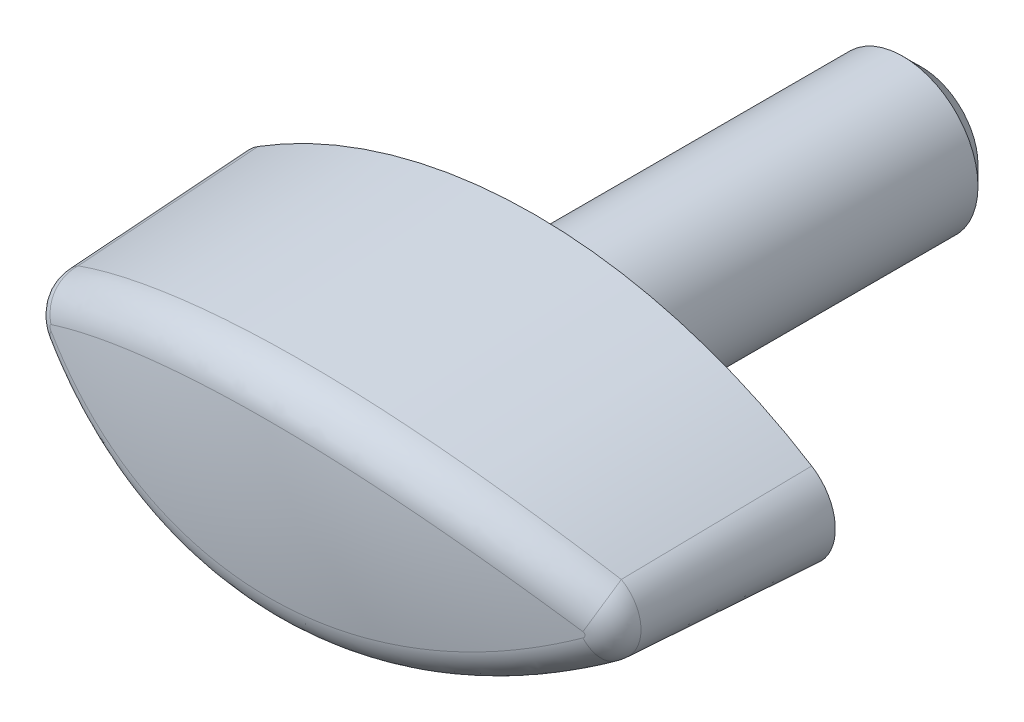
ISO-10303-21;
HEADER;
FILE_DESCRIPTION(('STEP AP214'),'2;1');
FILE_NAME('part.step','',(''),(''),'','','');
FILE_SCHEMA(('AUTOMOTIVE_DESIGN { 1 0 10303 214 1 1 1 1 }'));
ENDSEC;
DATA;
#1=APPLICATION_CONTEXT('core data for automotive mechanical design processes');
#2=APPLICATION_PROTOCOL_DEFINITION('international standard','automotive_design',2000,#1);
#3=PRODUCT_CONTEXT('',#1,'mechanical');
#4=PRODUCT('Part','Part','',(#3));
#5=PRODUCT_RELATED_PRODUCT_CATEGORY('part','',(#4));
#6=PRODUCT_DEFINITION_FORMATION('','',#4);
#7=PRODUCT_DEFINITION_CONTEXT('part definition',#1,'design');
#8=PRODUCT_DEFINITION('design','',#6,#7);
#9=PRODUCT_DEFINITION_SHAPE('','',#8);
#10=(LENGTH_UNIT() NAMED_UNIT(*) SI_UNIT(.MILLI.,.METRE.));
#11=(NAMED_UNIT(*) PLANE_ANGLE_UNIT() SI_UNIT($,.RADIAN.));
#12=(NAMED_UNIT(*) SI_UNIT($,.STERADIAN.) SOLID_ANGLE_UNIT());
#13=UNCERTAINTY_MEASURE_WITH_UNIT(LENGTH_MEASURE(1.E-05),#10,'distance_accuracy_value','');
#14=(GEOMETRIC_REPRESENTATION_CONTEXT(3) GLOBAL_UNCERTAINTY_ASSIGNED_CONTEXT((#13)) GLOBAL_UNIT_ASSIGNED_CONTEXT((#10,
#11,#12)) REPRESENTATION_CONTEXT('',''));
#15=CARTESIAN_POINT('',(0.,0.,0.));
#16=DIRECTION('',(0.,0.,1.));
#17=DIRECTION('',(1.,0.,0.));
#18=AXIS2_PLACEMENT_3D('',#15,#16,#17);
#19=CARTESIAN_POINT('',(0.,0.,0.));
#20=DIRECTION('',(0.,0.,1.));
#21=DIRECTION('',(1.,0.,0.));
#22=AXIS2_PLACEMENT_3D('',#19,#20,#21);
#23=PLANE('',#22);
#24=CARTESIAN_POINT('',(0.,0.,0.));
#25=DIRECTION('',(0.,0.,1.));
#26=DIRECTION('',(1.,0.,0.));
#27=AXIS2_PLACEMENT_3D('',#24,#25,#26);
#28=CIRCLE('',#27,5.);
#29=CARTESIAN_POINT('',(5.,0.,0.));
#30=VERTEX_POINT('',#29);
#31=EDGE_CURVE('E73',#30,#30,#28,.T.);
#32=ORIENTED_EDGE('',*,*,#31,.F.);
#33=EDGE_LOOP('',(#32));
#34=FACE_BOUND('',#33,.T.);
#35=CARTESIAN_POINT('',(0.,0.,0.));
#36=DIRECTION('',(0.,0.,1.));
#37=DIRECTION('',(1.,0.,0.));
#38=AXIS2_PLACEMENT_3D('',#35,#36,#37);
#39=CIRCLE('',#38,4.);
#40=CARTESIAN_POINT('',(4.,0.,0.));
#41=VERTEX_POINT('',#40);
#42=EDGE_CURVE('E244',#41,#41,#39,.F.);
#43=ORIENTED_EDGE('',*,*,#42,.F.);
#44=EDGE_LOOP('',(#43));
#45=FACE_BOUND('',#44,.T.);
#46=ADVANCED_FACE('F14',(#34,#45),#23,.F.);
#47=CARTESIAN_POINT('',(13.3241500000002,0.,0.6));
#48=DIRECTION('',(0.,0.,-1.));
#49=DIRECTION('',(1.,0.,0.));
#50=AXIS2_PLACEMENT_3D('',#47,#48,#49);
#51=CONICAL_SURFACE('',#50,2.67585,0.05235987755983);
#52=DIRECTION('',(0.0277113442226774,0.0443974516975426,-0.998629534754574));
#53=VECTOR('',#52,1.);
#54=CARTESIAN_POINT('',(14.740984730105,2.26996752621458,0.6));
#55=LINE('',#54,#53);
#56=CARTESIAN_POINT('',(14.4672021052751,1.83132944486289,10.4662631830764));
#57=VERTEX_POINT('',#56);
#58=CARTESIAN_POINT('',(14.740984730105,2.26996752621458,0.6));
#59=VERTEX_POINT('',#58);
#60=EDGE_CURVE('E67',#57,#59,#55,.T.);
#61=ORIENTED_EDGE('',*,*,#60,.F.);
#62=CARTESIAN_POINT('',(14.1108098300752,0.166021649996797,12.2354945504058));
#63=CARTESIAN_POINT('',(14.3791069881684,1.89963543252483,12.1178779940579));
#64=CARTESIAN_POINT('',(13.7556046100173,2.11406366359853,10.488000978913));
#65=CARTESIAN_POINT('',(14.1206757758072,0.164229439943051,12.2314837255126));
#66=CARTESIAN_POINT('',(14.4709389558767,1.84375069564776,12.0807327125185));
#67=CARTESIAN_POINT('',(13.8807542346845,2.08880404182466,10.4842046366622));
#68=CARTESIAN_POINT('',(14.1304087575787,0.161539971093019,12.2275262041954));
#69=CARTESIAN_POINT('',(14.5573909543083,1.78120267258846,12.0457616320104));
#70=CARTESIAN_POINT('',(14.0037556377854,2.05225919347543,10.4804587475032));
#71=CARTESIAN_POINT('',(14.149331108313,0.154432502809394,12.2198309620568));
#72=CARTESIAN_POINT('',(14.7174367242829,1.64606885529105,11.9810176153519));
#73=CARTESIAN_POINT('',(14.2421335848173,1.9576660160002,10.4731750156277));
#74=CARTESIAN_POINT('',(14.1585196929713,0.150012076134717,12.2160935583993));
#75=CARTESIAN_POINT('',(14.7913628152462,1.57353154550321,11.9511102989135));
#76=CARTESIAN_POINT('',(14.3574991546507,1.8995874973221,10.4696374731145));
#77=CARTESIAN_POINT('',(14.1753172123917,0.139950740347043,12.20926024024));
#78=CARTESIAN_POINT('',(14.9209668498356,1.42684806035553,11.8986754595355));
#79=CARTESIAN_POINT('',(14.5677797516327,1.76874922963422,10.4631695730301));
#80=CARTESIAN_POINT('',(14.1829939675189,0.134441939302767,12.2061368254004));
#81=CARTESIAN_POINT('',(14.9778340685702,1.3534010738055,11.8756670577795));
#82=CARTESIAN_POINT('',(14.663597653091,1.69761255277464,10.460213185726));
#83=CARTESIAN_POINT('',(14.1973956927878,0.12213486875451,12.2002765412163));
#84=CARTESIAN_POINT('',(15.0810613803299,1.20116793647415,11.8338996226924));
#85=CARTESIAN_POINT('',(14.8429330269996,1.53964661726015,10.4546662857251));
#86=CARTESIAN_POINT('',(14.2041215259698,0.115337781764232,12.1975393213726));
#87=CARTESIAN_POINT('',(15.1276484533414,1.12231233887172,11.815048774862));
#88=CARTESIAN_POINT('',(14.9264616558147,1.45283175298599,10.4520754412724));
#89=CARTESIAN_POINT('',(14.2164165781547,0.100570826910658,12.1925350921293));
#90=CARTESIAN_POINT('',(15.2105709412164,0.960026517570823,11.7814940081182));
#91=CARTESIAN_POINT('',(15.0788595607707,1.26502385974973,10.4473388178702));
#92=CARTESIAN_POINT('',(14.2219817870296,0.0925970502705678,12.1902697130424));
#93=CARTESIAN_POINT('',(15.2470602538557,0.876453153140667,11.7667278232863));
#94=CARTESIAN_POINT('',(15.1476780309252,1.16398362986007,10.445194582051));
#95=CARTESIAN_POINT('',(14.2317036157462,0.07569974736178,12.1863120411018));
#96=CARTESIAN_POINT('',(15.3095362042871,0.706031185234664,11.7414448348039));
#97=CARTESIAN_POINT('',(15.2677226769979,0.950505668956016,10.4414485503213));
#98=CARTESIAN_POINT('',(14.2358602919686,0.066776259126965,12.1846197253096));
#99=CARTESIAN_POINT('',(15.3356733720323,0.619012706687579,11.7308671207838));
#100=CARTESIAN_POINT('',(15.3189495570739,0.838068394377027,10.4398467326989));
#101=CARTESIAN_POINT('',(14.2423821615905,0.0487906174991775,12.1819643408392));
#102=CARTESIAN_POINT('',(15.3761517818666,0.447923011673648,11.7144851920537));
#103=CARTESIAN_POINT('',(15.3992531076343,0.611876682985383,10.4373333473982));
#104=CARTESIAN_POINT('',(14.2448371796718,0.0397664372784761,12.1809647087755));
#105=CARTESIAN_POINT('',(15.3911740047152,0.363819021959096,11.7084054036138));
#106=CARTESIAN_POINT('',(15.4294409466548,0.498575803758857,10.4363871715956));
#107=CARTESIAN_POINT('',(14.2482229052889,0.0213918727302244,12.1795860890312));
#108=CARTESIAN_POINT('',(15.4117646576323,0.194703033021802,11.7000719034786));
#109=CARTESIAN_POINT('',(15.4710596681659,0.268088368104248,10.4350822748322));
#110=CARTESIAN_POINT('',(14.2491542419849,0.0120416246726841,12.1792068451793));
#111=CARTESIAN_POINT('',(15.4173844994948,0.109500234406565,11.6977973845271));
#112=CARTESIAN_POINT('',(15.4824982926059,0.150903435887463,10.4347233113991));
#113=CARTESIAN_POINT('',(14.2494441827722,-0.00620208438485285,12.1790887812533));
#114=CARTESIAN_POINT('',(15.4191340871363,-0.0563876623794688,11.6970892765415));
#115=CARTESIAN_POINT('',(15.4860599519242,-0.0777237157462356,10.4346115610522));
#116=CARTESIAN_POINT('',(14.2488815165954,-0.0150942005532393,12.1793179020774));
#117=CARTESIAN_POINT('',(15.4157428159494,-0.137252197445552,11.6984618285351));
#118=CARTESIAN_POINT('',(15.4791499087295,-0.189150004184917,10.4348284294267));
#119=CARTESIAN_POINT('',(14.2463728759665,-0.0326463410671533,12.1803393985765));
#120=CARTESIAN_POINT('',(15.4005322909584,-0.298022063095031,11.7046179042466));
#121=CARTESIAN_POINT('',(15.4483205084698,-0.409237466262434,10.4357953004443));
#122=CARTESIAN_POINT('',(14.2444270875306,-0.0413063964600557,12.1811316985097));
#123=CARTESIAN_POINT('',(15.3886824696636,-0.378093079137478,11.7094137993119));
#124=CARTESIAN_POINT('',(15.4244034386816,-0.517899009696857,10.4365452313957));
#125=CARTESIAN_POINT('',(14.2392436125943,-0.05811181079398,12.1832422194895));
#126=CARTESIAN_POINT('',(15.3567481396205,-0.536043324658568,11.7223380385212));
#127=CARTESIAN_POINT('',(15.3606175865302,-0.729051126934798,10.4385428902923));
#128=CARTESIAN_POINT('',(14.2360125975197,-0.0662595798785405,12.1845577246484));
#129=CARTESIAN_POINT('',(15.3366416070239,-0.614083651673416,11.7304752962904));
#130=CARTESIAN_POINT('',(15.3208311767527,-0.831570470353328,10.4397880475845));
#131=CARTESIAN_POINT('',(14.2283768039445,-0.0818874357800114,12.1876663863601));
#132=CARTESIAN_POINT('',(15.2883129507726,-0.767675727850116,11.7500336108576));
#133=CARTESIAN_POINT('',(15.226660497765,-1.02861357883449,10.442730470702));
#134=CARTESIAN_POINT('',(14.2239716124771,-0.0893672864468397,12.1894597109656));
#135=CARTESIAN_POINT('',(15.2599944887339,-0.843356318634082,11.7614936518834));
#136=CARTESIAN_POINT('',(15.1722710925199,-1.12313451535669,10.4444278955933));
#137=CARTESIAN_POINT('',(14.2139302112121,-0.103786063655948,12.1935471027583));
#138=CARTESIAN_POINT('',(15.1939882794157,-0.994616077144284,11.7882042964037));
#139=CARTESIAN_POINT('',(15.0480588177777,-1.30585339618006,10.4482967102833));
#140=CARTESIAN_POINT('',(14.2082503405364,-0.110689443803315,12.1958589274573));
#141=CARTESIAN_POINT('',(15.155838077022,-1.07014975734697,11.8036419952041));
#142=CARTESIAN_POINT('',(14.9776871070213,-1.39362351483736,10.4504849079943));
#143=CARTESIAN_POINT('',(14.1959655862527,-0.123440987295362,12.2008584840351));
#144=CARTESIAN_POINT('',(15.0709364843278,-1.2168712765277,11.8379963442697));
#145=CARTESIAN_POINT('',(14.8251308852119,-1.55637651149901,10.4552171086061));
#146=CARTESIAN_POINT('',(14.1893618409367,-0.129290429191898,12.203545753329));
#147=CARTESIAN_POINT('',(15.024034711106,-1.2881490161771,11.8569738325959));
#148=CARTESIAN_POINT('',(14.7429609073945,-1.63137487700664,10.4577606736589));
#149=CARTESIAN_POINT('',(14.1776162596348,-0.13817907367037,12.2083247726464));
#150=CARTESIAN_POINT('',(14.9379254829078,-1.40369864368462,11.8918138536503));
#151=CARTESIAN_POINT('',(14.5964379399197,-1.74592665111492,10.4622841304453));
#152=CARTESIAN_POINT('',(14.1726684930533,-0.141523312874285,12.2103377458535));
#153=CARTESIAN_POINT('',(14.9007627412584,-1.4495731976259,11.9068495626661));
#154=CARTESIAN_POINT('',(14.5346172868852,-1.78920650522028,10.4641894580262));
#155=CARTESIAN_POINT('',(14.1588637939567,-0.149828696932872,12.2159535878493));
#156=CARTESIAN_POINT('',(14.7940855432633,-1.57068387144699,11.9500087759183));
#157=CARTESIAN_POINT('',(14.3618137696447,-1.89719077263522,10.469504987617));
#158=CARTESIAN_POINT('',(14.1497242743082,-0.154253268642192,12.2196710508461));
#159=CARTESIAN_POINT('',(14.7206446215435,-1.64302902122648,11.9797198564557));
#160=CARTESIAN_POINT('',(14.2470740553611,-1.95530528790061,10.4730236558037));
#161=CARTESIAN_POINT('',(14.1308196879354,-0.16141615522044,12.2273591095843));
#162=CARTESIAN_POINT('',(14.5609853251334,-1.77849193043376,12.0443076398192));
#163=CARTESIAN_POINT('',(14.0089448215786,-2.05058717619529,10.4803005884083));
#164=CARTESIAN_POINT('',(14.1210506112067,-0.164142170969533,12.2313313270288));
#165=CARTESIAN_POINT('',(14.4743389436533,-1.84146859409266,12.0793574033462));
#166=CARTESIAN_POINT('',(13.8854992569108,-2.08760160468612,10.4840603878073));
#167=CARTESIAN_POINT('',(14.111152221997,-0.16595885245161,12.2353553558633));
#168=CARTESIAN_POINT('',(14.3823216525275,-1.89767545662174,12.1165776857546));
#169=CARTESIAN_POINT('',(13.7599471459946,-2.11317980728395,10.4878692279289));
#170=(BOUNDED_SURFACE() B_SPLINE_SURFACE(3,2,((#62,#63,#64),(#65,#66,#67),(#68,#69,#70),(#71,
#72,#73),(#74,#75,#76),(#77,#78,#79),(#80,#81,#82),(#83,#84,#85),(#86,#87,#88),(#89,#90,#91),
(#92,#93,#94),(#95,#96,#97),(#98,#99,#100),(#101,#102,#103),(#104,#105,#106),(#107,#108,#109),
(#110,#111,#112),(#113,#114,#115),(#116,#117,#118),(#119,#120,#121),(#122,#123,#124),(#125,#126,
#127),(#128,#129,#130),(#131,#132,#133),(#134,#135,#136),(#137,#138,#139),(#140,#141,#142),
(#143,#144,#145),(#146,#147,#148),(#149,#150,#151),(#152,#153,#154),(#155,#156,#157),(#158,#159,
#160),(#161,#162,#163),(#164,#165,#166),(#167,#168,#169)),.UNSPECIFIED.,.F.,.F.,
.F.) B_SPLINE_SURFACE_WITH_KNOTS((4,2,2,2,2,2,2,2,2,2,2,2,2,2,2,2,2,4),(3,3),(0.,
0.0306443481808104,0.0613318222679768,0.0894666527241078,0.117575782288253,0.145780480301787,
0.173984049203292,0.200553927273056,0.227112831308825,0.252300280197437,0.27748434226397,
0.30253934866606,0.327603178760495,0.353711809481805,0.379788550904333,0.39765775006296,
0.428206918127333,0.458974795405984),(0.,1.),
.UNSPECIFIED.) GEOMETRIC_REPRESENTATION_ITEM() RATIONAL_B_SPLINE_SURFACE(((1.,0.751050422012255,
1.),(1.,0.758307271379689,1.),(1.,0.765328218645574,1.),(1.,0.778762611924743,1.),(1.,
0.785175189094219,1.),(1.,0.79673428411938,1.),(1.,0.801941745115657,1.),(1.,0.811605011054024,
1.),(1.,0.816061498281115,1.),(1.,0.824136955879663,1.),(1.,0.827753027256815,1.),(1.,
0.834029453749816,1.),(1.,0.836689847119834,1.),(1.,0.8408477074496,1.),(1.,0.842403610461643,
1.),(1.,0.844546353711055,1.),(1.,0.845133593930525,1.),(1.,0.845316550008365,1.),(1.,
0.844961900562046,1.),(1.,0.843376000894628,1.),(1.,0.842144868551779,1.),(1.,0.838848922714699,
1.),(1.,0.836788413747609,1.),(1.,0.831885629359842,1.),(1.,0.829043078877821,1.),(1.,
0.822508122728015,1.),(1.,0.818785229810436,1.),(1.,0.810646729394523,1.),(1.,0.806231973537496,
1.),(1.,0.798283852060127,1.),(1.,0.79491041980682,1.),(1.,0.785413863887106,1.),(1.,
0.779038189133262,1.),(1.,0.765623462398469,1.),(1.,0.758579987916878,1.),(1.,0.75130211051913,1.))) REPRESENTATION_ITEM('') SURFACE());
#171=CARTESIAN_POINT('',(13.7556046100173,2.11406366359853,10.488000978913));
#172=CARTESIAN_POINT('',(13.8807542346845,2.08880404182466,10.4842046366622));
#173=CARTESIAN_POINT('',(14.0037556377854,2.05225919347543,10.4804587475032));
#174=CARTESIAN_POINT('',(14.2421335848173,1.9576660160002,10.4731750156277));
#175=CARTESIAN_POINT('',(14.3574991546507,1.8995874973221,10.4696374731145));
#176=CARTESIAN_POINT('',(14.5677797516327,1.76874922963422,10.4631695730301));
#177=CARTESIAN_POINT('',(14.663597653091,1.69761255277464,10.460213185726));
#178=CARTESIAN_POINT('',(14.8429330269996,1.53964661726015,10.4546662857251));
#179=CARTESIAN_POINT('',(14.9264616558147,1.45283175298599,10.4520754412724));
#180=CARTESIAN_POINT('',(15.0788595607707,1.26502385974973,10.4473388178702));
#181=CARTESIAN_POINT('',(15.1476780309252,1.16398362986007,10.445194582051));
#182=CARTESIAN_POINT('',(15.2677226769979,0.950505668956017,10.4414485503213));
#183=CARTESIAN_POINT('',(15.3189495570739,0.838068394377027,10.4398467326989));
#184=CARTESIAN_POINT('',(15.3992531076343,0.611876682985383,10.4373333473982));
#185=CARTESIAN_POINT('',(15.4294409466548,0.498575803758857,10.4363871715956));
#186=CARTESIAN_POINT('',(15.4710596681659,0.268088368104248,10.4350822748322));
#187=CARTESIAN_POINT('',(15.4824982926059,0.150903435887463,10.4347233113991));
#188=CARTESIAN_POINT('',(15.4860599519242,-0.0777237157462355,10.4346115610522));
#189=CARTESIAN_POINT('',(15.4791499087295,-0.189150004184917,10.4348284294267));
#190=CARTESIAN_POINT('',(15.4483205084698,-0.409237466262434,10.4357953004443));
#191=CARTESIAN_POINT('',(15.4244034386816,-0.517899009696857,10.4365452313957));
#192=CARTESIAN_POINT('',(15.3606175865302,-0.729051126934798,10.4385428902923));
#193=CARTESIAN_POINT('',(15.3208311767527,-0.831570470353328,10.4397880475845));
#194=CARTESIAN_POINT('',(15.226660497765,-1.02861357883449,10.442730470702));
#195=CARTESIAN_POINT('',(15.1722710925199,-1.12313451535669,10.4444278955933));
#196=CARTESIAN_POINT('',(15.0480588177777,-1.30585339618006,10.4482967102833));
#197=CARTESIAN_POINT('',(14.9776871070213,-1.39362351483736,10.4504849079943));
#198=CARTESIAN_POINT('',(14.8251308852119,-1.55637651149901,10.4552171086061));
#199=CARTESIAN_POINT('',(14.7429609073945,-1.63137487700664,10.4577606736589));
#200=CARTESIAN_POINT('',(14.5964379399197,-1.74592665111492,10.4622841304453));
#201=CARTESIAN_POINT('',(14.5346172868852,-1.78920650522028,10.4641894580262));
#202=CARTESIAN_POINT('',(14.3618137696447,-1.89719077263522,10.469504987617));
#203=CARTESIAN_POINT('',(14.2470740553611,-1.95530528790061,10.4730236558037));
#204=CARTESIAN_POINT('',(14.0089448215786,-2.05058717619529,10.4803005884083));
#205=CARTESIAN_POINT('',(13.8854992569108,-2.08760160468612,10.4840603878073));
#206=CARTESIAN_POINT('',(13.7599471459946,-2.11317980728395,10.4878692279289));
#207=B_SPLINE_CURVE_WITH_KNOTS('',3,(#171,#172,#173,#174,#175,#176,#177,#178,#179,#180,#181,
#182,#183,#184,#185,#186,#187,#188,#189,#190,#191,#192,#193,#194,#195,#196,#197,#198,#199,#200,
#201,#202,#203,#204,#205,#206),.UNSPECIFIED.,.F.,.F.,(4,2,2,2,2,2,2,2,2,2,2,2,2,2,2,2,2,4),(0.,
0.0306443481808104,0.0613318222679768,0.0894666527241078,0.117575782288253,0.145780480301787,
0.173984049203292,0.200553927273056,0.227112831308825,0.252300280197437,0.27748434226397,
0.30253934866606,0.327603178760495,0.353711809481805,0.379788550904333,0.39765775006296,
0.428206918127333,0.458974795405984),.UNSPECIFIED.);
#208=CARTESIAN_POINT('',(14.4708427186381,-1.82905899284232,10.4661511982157));
#209=VERTEX_POINT('',#208);
#210=EDGE_CURVE('E37',#57,#209,#207,.T.);
#211=ORIENTED_EDGE('',*,*,#210,.T.);
#212=DIRECTION('',(0.02779952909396,-0.0443422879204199,-0.998629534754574));
#213=VECTOR('',#212,1.);
#214=CARTESIAN_POINT('',(14.7454934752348,-2.26714709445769,0.6));
#215=LINE('',#214,#213);
#216=CARTESIAN_POINT('',(14.7454934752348,-2.2671470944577,0.6));
#217=VERTEX_POINT('',#216);
#218=EDGE_CURVE('E86',#209,#217,#215,.T.);
#219=ORIENTED_EDGE('',*,*,#218,.T.);
#220=CARTESIAN_POINT('',(13.3241500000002,0.,0.6));
#221=DIRECTION('',(0.,0.,1.));
#222=DIRECTION('',(1.,0.,0.));
#223=AXIS2_PLACEMENT_3D('',#220,#221,#222);
#224=CIRCLE('',#223,2.67585);
#225=EDGE_CURVE('E81',#217,#59,#224,.T.);
#226=ORIENTED_EDGE('',*,*,#225,.T.);
#227=EDGE_LOOP('',(#61,#211,#219,#226));
#228=FACE_BOUND('',#227,.T.);
#229=ADVANCED_FACE('F85',(#228),#51,.T.);
#230=CARTESIAN_POINT('',(0.,-21.3471530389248,0.6));
#231=DIRECTION('',(0.,0.,-1.));
#232=DIRECTION('',(-1.,0.,0.));
#233=AXIS2_PLACEMENT_3D('',#230,#231,#232);
#234=CONICAL_SURFACE('',#233,27.8399894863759,0.05235987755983);
#235=DIRECTION('',(-0.0277113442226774,0.0443974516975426,-0.998629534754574));
#236=VECTOR('',#235,1.);
#237=CARTESIAN_POINT('',(-14.740984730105,2.26996752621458,0.6));
#238=LINE('',#237,#236);
#239=CARTESIAN_POINT('',(-14.4672021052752,1.83132944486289,10.4662631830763));
#240=VERTEX_POINT('',#239);
#241=CARTESIAN_POINT('',(-14.740984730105,2.26996752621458,0.6));
#242=VERTEX_POINT('',#241);
#243=EDGE_CURVE('E74',#240,#242,#238,.T.);
#244=ORIENTED_EDGE('',*,*,#243,.F.);
#245=CARTESIAN_POINT('',(-20.930406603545,-5.54084379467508,8.09552638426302));
#246=CARTESIAN_POINT('',(-21.7410431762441,-4.547930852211,7.71955722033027));
#247=CARTESIAN_POINT('',(-21.361002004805,-3.98479936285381,6.56942148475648));
#248=CARTESIAN_POINT('',(-20.7004619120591,-5.27506526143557,8.30163695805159));
#249=CARTESIAN_POINT('',(-21.5106243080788,-4.267807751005,7.92859864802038));
#250=CARTESIAN_POINT('',(-21.1269474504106,-3.71304857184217,6.76451010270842));
#251=CARTESIAN_POINT('',(-20.4639828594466,-5.01179059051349,8.50361247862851));
#252=CARTESIAN_POINT('',(-21.2736472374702,-3.99057334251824,8.13321259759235));
#253=CARTESIAN_POINT('',(-20.8861918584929,-3.44383895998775,6.95568479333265));
#254=CARTESIAN_POINT('',(-19.9779223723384,-4.49104867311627,8.89918767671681));
#255=CARTESIAN_POINT('',(-20.7855257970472,-3.44141472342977,8.53446912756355));
#256=CARTESIAN_POINT('',(-20.3912429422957,-2.91132293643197,7.33010623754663));
#257=CARTESIAN_POINT('',(-19.7283396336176,-4.23358200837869,9.09278651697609));
#258=CARTESIAN_POINT('',(-20.5343330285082,-3.16953159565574,8.73106329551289));
#259=CARTESIAN_POINT('',(-20.1370482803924,-2.648017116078,7.51335219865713));
#260=CARTESIAN_POINT('',(-18.9595965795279,-3.47081594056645,9.66106473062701));
#261=CARTESIAN_POINT('',(-19.7573480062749,-2.36110754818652,9.31014355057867));
#262=CARTESIAN_POINT('',(-19.3539579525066,-1.86790264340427,8.05124120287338));
#263=CARTESIAN_POINT('',(-18.4207642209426,-2.97552593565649,10.0229360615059));
#264=CARTESIAN_POINT('',(-19.2115942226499,-1.83598658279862,9.67881599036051));
#265=CARTESIAN_POINT('',(-18.8048845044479,-1.36128089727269,8.39376112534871));
#266=CARTESIAN_POINT('',(-17.2908790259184,-2.01786439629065,10.7116700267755));
#267=CARTESIAN_POINT('',(-18.0626793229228,-0.81734006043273,10.3825698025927));
#268=CARTESIAN_POINT('',(-17.6531688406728,-0.381598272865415,9.04566439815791));
#269=CARTESIAN_POINT('',(-16.6996961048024,-1.55558032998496,11.0384407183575));
#270=CARTESIAN_POINT('',(-17.4591825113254,-0.324431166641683,10.7170947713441));
#271=CARTESIAN_POINT('',(-17.0503931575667,0.0913734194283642,9.35496072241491));
#272=CARTESIAN_POINT('',(-15.4688973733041,-0.672564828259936,11.6542030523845));
#273=CARTESIAN_POINT('',(-16.1979631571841,0.620232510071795,11.3493931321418));
#274=CARTESIAN_POINT('',(-15.7951373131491,0.994894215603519,9.93779458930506));
#275=CARTESIAN_POINT('',(-14.8293034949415,-0.251814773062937,11.9432116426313));
#276=CARTESIAN_POINT('',(-15.5402244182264,1.0713800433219,11.6466903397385));
#277=CARTESIAN_POINT('',(-15.1426796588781,1.42546232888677,10.2113481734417));
#278=CARTESIAN_POINT('',(-13.6124946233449,0.477104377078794,12.4382223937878));
#279=CARTESIAN_POINT('',(-14.2850820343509,1.85512119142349,12.1571613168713));
#280=CARTESIAN_POINT('',(-13.901136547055,2.17145532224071,10.6798877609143));
#281=CARTESIAN_POINT('',(-13.0419564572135,0.792469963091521,12.6500870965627));
#282=CARTESIAN_POINT('',(-13.6946450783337,2.19501685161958,12.3760860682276));
#283=CARTESIAN_POINT('',(-13.3189045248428,2.49423413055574,10.880422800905));
#284=CARTESIAN_POINT('',(-11.8721076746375,1.3854487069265,13.045204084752));
#285=CARTESIAN_POINT('',(-12.4805399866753,2.83582708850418,12.7853667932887));
#286=CARTESIAN_POINT('',(-12.1249028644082,3.10119046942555,11.2544105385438));
#287=CARTESIAN_POINT('',(-11.2728009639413,1.66306696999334,13.2284602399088));
#288=CARTESIAN_POINT('',(-11.8570881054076,3.13631705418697,12.9754314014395));
#289=CARTESIAN_POINT('',(-11.5131372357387,3.38537322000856,11.4278668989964));
#290=CARTESIAN_POINT('',(-10.0497544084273,2.17658965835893,13.5651544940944));
#291=CARTESIAN_POINT('',(-10.5814304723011,3.69355654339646,13.3254494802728));
#292=CARTESIAN_POINT('',(-10.2645139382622,3.9110665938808,11.7465561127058));
#293=CARTESIAN_POINT('',(-9.42605842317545,2.41256510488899,13.718643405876));
#294=CARTESIAN_POINT('',(-9.92960151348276,3.9499601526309,13.4851771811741));
#295=CARTESIAN_POINT('',(-9.62770130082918,4.15264986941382,11.8918370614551));
#296=CARTESIAN_POINT('',(-8.15711575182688,2.84026101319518,13.9953538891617));
#297=CARTESIAN_POINT('',(-8.60031267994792,4.41576965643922,13.773759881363));
#298=CARTESIAN_POINT('',(-8.33194721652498,4.59052848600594,12.1537501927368));
#299=CARTESIAN_POINT('',(-7.51186909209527,3.03198152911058,14.1185754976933));
#300=CARTESIAN_POINT('',(-7.92330078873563,4.62478414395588,13.9023650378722));
#301=CARTESIAN_POINT('',(-7.67300579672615,4.78682388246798,12.2703824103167));
#302=CARTESIAN_POINT('',(-6.20206423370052,3.36907181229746,14.3343736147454));
#303=CARTESIAN_POINT('',(-6.54624797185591,4.99304862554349,14.1280313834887));
#304=CARTESIAN_POINT('',(-6.33530350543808,5.13196895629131,12.4746405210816));
#305=CARTESIAN_POINT('',(-5.53745046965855,3.51429011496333,14.4268500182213));
#306=CARTESIAN_POINT('',(-5.84670761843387,5.15179618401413,14.2247777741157));
#307=CARTESIAN_POINT('',(-5.65648557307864,5.28066359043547,12.5621716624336));
#308=CARTESIAN_POINT('',(-4.19571386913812,3.75546170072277,14.5800346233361));
#309=CARTESIAN_POINT('',(-4.4321676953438,5.41590302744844,14.3853044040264));
#310=CARTESIAN_POINT('',(-4.28600316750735,5.52761370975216,12.7071645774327));
#311=CARTESIAN_POINT('',(-3.51859089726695,3.8514144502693,14.6407424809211));
#312=CARTESIAN_POINT('',(-3.71782004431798,5.52100436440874,14.4489266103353));
#313=CARTESIAN_POINT('',(-3.59433855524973,5.62586864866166,12.7646260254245));
#314=CARTESIAN_POINT('',(-2.15653707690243,3.99270187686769,14.7300250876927));
#315=CARTESIAN_POINT('',(-2.27918661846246,5.67597876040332,14.5426217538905));
#316=CARTESIAN_POINT('',(-2.20299283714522,5.77054741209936,12.8491341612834));
#317=CARTESIAN_POINT('',(-1.47160152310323,4.03800422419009,14.7585793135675));
#318=CARTESIAN_POINT('',(-1.55561281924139,5.72565919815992,14.5725779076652));
#319=CARTESIAN_POINT('',(-1.50330689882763,5.81693813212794,12.8761614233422));
#320=CARTESIAN_POINT('',(-0.099695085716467,4.07721043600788,14.7832952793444));
#321=CARTESIAN_POINT('',(-0.105290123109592,5.76869686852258,14.5985331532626));
#322=CARTESIAN_POINT('',(-0.101844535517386,5.85708620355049,12.8995556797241));
#323=CARTESIAN_POINT('',(0.5872757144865,4.07111637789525,14.779458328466));
#324=CARTESIAN_POINT('',(0.62070953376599,5.76201188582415,14.5945067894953));
#325=CARTESIAN_POINT('',(0.5999318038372,5.8508456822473,12.8959239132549));
#326=CARTESIAN_POINT('',(1.93086467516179,4.0088809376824,14.7402116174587));
#327=CARTESIAN_POINT('',(2.04094432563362,5.69370033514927,14.5532952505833));
#328=CARTESIAN_POINT('',(1.97245978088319,5.78711531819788,12.8587759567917));
#329=CARTESIAN_POINT('',(2.58761241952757,3.95472063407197,14.7060516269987));
#330=CARTESIAN_POINT('',(2.73461323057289,5.63431387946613,14.5174620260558));
#331=CARTESIAN_POINT('',(2.6433445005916,5.73165413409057,12.8264427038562));
#332=CARTESIAN_POINT('',(3.89335170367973,3.79980545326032,14.6080794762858));
#333=CARTESIAN_POINT('',(4.11336288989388,5.46443501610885,14.4146710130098));
#334=CARTESIAN_POINT('',(3.97714814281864,5.57302153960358,12.7337097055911));
#335=CARTESIAN_POINT('',(4.54234318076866,3.69905019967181,14.5442670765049));
#336=CARTESIAN_POINT('',(4.79781680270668,5.35410028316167,14.3478089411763));
#337=CARTESIAN_POINT('',(4.64006700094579,5.46984974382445,12.6733097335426));
#338=CARTESIAN_POINT('',(5.82744950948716,3.45240071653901,14.3874367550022));
#339=CARTESIAN_POINT('',(6.15214016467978,5.08408369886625,14.183509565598));
#340=CARTESIAN_POINT('',(5.95268411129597,5.21729265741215,12.5248660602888));
#341=CARTESIAN_POINT('',(6.46357612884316,3.30654992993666,14.2944469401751));
#342=CARTESIAN_POINT('',(6.82145498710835,4.92469033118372,14.0862496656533));
#343=CARTESIAN_POINT('',(6.60239444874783,5.06795184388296,12.4368489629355));
#344=CARTESIAN_POINT('',(7.71921398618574,2.97165684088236,14.0798148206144));
#345=CARTESIAN_POINT('',(8.14103660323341,4.55894972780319,13.861868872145));
#346=CARTESIAN_POINT('',(7.88475364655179,4.72505955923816,12.2336944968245));
#347=CARTESIAN_POINT('',(8.3387274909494,2.78262046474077,13.9581764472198));
#348=CARTESIAN_POINT('',(8.79082047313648,4.35291539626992,13.7349435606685));
#349=CARTESIAN_POINT('',(8.51740483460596,4.53151415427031,12.1185608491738));
#350=CARTESIAN_POINT('',(9.87188364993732,2.25556965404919,13.6168535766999));
#351=CARTESIAN_POINT('',(10.3946908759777,3.7796641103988,13.3794408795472));
#352=CARTESIAN_POINT('',(10.0829301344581,3.99191937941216,11.7954905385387));
#353=CARTESIAN_POINT('',(10.7725226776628,1.89099127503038,13.378950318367));
#354=CARTESIAN_POINT('',(11.3344018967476,3.38422765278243,13.1322848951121));
#355=CARTESIAN_POINT('',(11.0024508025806,3.61868668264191,11.5703093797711));
#356=CARTESIAN_POINT('',(12.51579746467,1.07787551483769,12.8413283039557));
#357=CARTESIAN_POINT('',(13.1479104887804,2.50379946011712,12.5744407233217));
#358=CARTESIAN_POINT('',(12.781941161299,2.78635444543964,11.061437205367));
#359=CARTESIAN_POINT('',(13.3584048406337,0.629297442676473,12.541579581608));
#360=CARTESIAN_POINT('',(14.0208513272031,2.02009902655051,12.2646196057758));
#361=CARTESIAN_POINT('',(13.6418817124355,2.32721328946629,10.7777178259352));
#362=CARTESIAN_POINT('',(14.8280629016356,-0.251057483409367,11.9437238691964));
#363=CARTESIAN_POINT('',(15.5389439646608,1.07219108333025,11.647215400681));
#364=CARTESIAN_POINT('',(15.1414139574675,1.42623735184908,10.2118330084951));
#365=CARTESIAN_POINT('',(15.4663339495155,-0.670873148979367,11.6553645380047));
#366=CARTESIAN_POINT('',(16.1953342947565,0.622040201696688,11.3505835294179));
#367=CARTESIAN_POINT('',(15.79252236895,0.996625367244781,9.93889396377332));
#368=CARTESIAN_POINT('',(16.6949333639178,-1.55201673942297,11.0409438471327));
#369=CARTESIAN_POINT('',(17.454323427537,-0.320632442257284,10.7196566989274));
#370=CARTESIAN_POINT('',(17.0455363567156,0.0950195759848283,9.35732999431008));
#371=CARTESIAN_POINT('',(17.2852280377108,-2.01337336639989,10.7148563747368));
#372=CARTESIAN_POINT('',(18.0569246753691,-0.812560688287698,10.3858260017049));
#373=CARTESIAN_POINT('',(17.6474073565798,-0.377003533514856,9.0486803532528));
#374=CARTESIAN_POINT('',(18.4156488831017,-2.9708948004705,10.0263097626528));
#375=CARTESIAN_POINT('',(19.2063992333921,-1.83106388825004,9.68226181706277));
#376=CARTESIAN_POINT('',(18.7996716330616,-1.35654370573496,8.39695441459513));
#377=CARTESIAN_POINT('',(18.9557117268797,-3.46710219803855,9.66380587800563));
#378=CARTESIAN_POINT('',(19.7534125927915,-2.357165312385,9.31294056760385));
#379=CARTESIAN_POINT('',(19.349999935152,-1.86410419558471,8.05383576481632));
#380=CARTESIAN_POINT('',(19.7260881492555,-4.23127814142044,9.09451567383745));
#381=CARTESIAN_POINT('',(20.5320642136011,-3.16709587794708,8.73282122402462));
#382=CARTESIAN_POINT('',(20.1347551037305,-2.64566096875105,7.51498888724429));
#383=CARTESIAN_POINT('',(19.9761533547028,-4.48918945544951,8.90059285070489));
#384=CARTESIAN_POINT('',(20.7837454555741,-3.43945055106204,8.5358968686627));
#385=CARTESIAN_POINT('',(20.3894414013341,-2.90942161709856,7.33143626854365));
#386=CARTESIAN_POINT('',(20.4631333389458,-5.01084463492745,8.50433817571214));
#387=CARTESIAN_POINT('',(21.2727940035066,-3.98957500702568,8.13394940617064));
#388=CARTESIAN_POINT('',(20.8853269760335,-3.4428716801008,6.95637168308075));
#389=CARTESIAN_POINT('',(20.7000493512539,-5.2745879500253,8.30200711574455));
#390=CARTESIAN_POINT('',(21.5102098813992,-4.26730350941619,7.92897492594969));
#391=CARTESIAN_POINT('',(21.1265275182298,-3.71256053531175,6.76486046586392));
#392=CARTESIAN_POINT('',(20.9304066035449,-5.54084379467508,8.09552638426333));
#393=CARTESIAN_POINT('',(21.7410431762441,-4.547930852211,7.71955722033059));
#394=CARTESIAN_POINT('',(21.361002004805,-3.98479936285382,6.56942148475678));
#395=(BOUNDED_SURFACE() B_SPLINE_SURFACE(3,2,((#245,#246,#247),(#248,#249,#250),(#251,#252,
#253),(#254,#255,#256),(#257,#258,#259),(#260,#261,#262),(#263,#264,#265),(#266,#267,#268),
(#269,#270,#271),(#272,#273,#274),(#275,#276,#277),(#278,#279,#280),(#281,#282,#283),(#284,#285,
#286),(#287,#288,#289),(#290,#291,#292),(#293,#294,#295),(#296,#297,#298),(#299,#300,#301),
(#302,#303,#304),(#305,#306,#307),(#308,#309,#310),(#311,#312,#313),(#314,#315,#316),(#317,#318,
#319),(#320,#321,#322),(#323,#324,#325),(#326,#327,#328),(#329,#330,#331),(#332,#333,#334),
(#335,#336,#337),(#338,#339,#340),(#341,#342,#343),(#344,#345,#346),(#347,#348,#349),(#350,#351,
#352),(#353,#354,#355),(#356,#357,#358),(#359,#360,#361),(#362,#363,#364),(#365,#366,#367),
(#368,#369,#370),(#371,#372,#373),(#374,#375,#376),(#377,#378,#379),(#380,#381,#382),(#383,#384,
#385),(#386,#387,#388),(#389,#390,#391),(#392,#393,#394)),.UNSPECIFIED.,.F.,.F.,
.F.) B_SPLINE_SURFACE_WITH_KNOTS((4,2,2,2,2,2,2,2,2,2,2,2,2,2,2,2,2,2,2,2,2,2,2,2,4),(3,3),(0.,
1.15675494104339,2.31362523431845,4.62898987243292,6.95027863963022,9.27052199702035,
11.2149387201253,13.1590922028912,15.0998972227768,17.0406998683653,18.9877611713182,
20.9348435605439,22.8831680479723,24.8314137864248,26.7029081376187,28.5744176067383,
30.444129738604,32.3135854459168,35.1467321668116,37.9812548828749,40.2968026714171,
42.6139628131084,44.9340057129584,46.0929475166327,47.2517804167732),(0.,1.),
.UNSPECIFIED.) GEOMETRIC_REPRESENTATION_ITEM() RATIONAL_B_SPLINE_SURFACE(((1.,0.83157670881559,
1.),(1.,0.829747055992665,1.),(1.,0.827926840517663,1.),(1.,0.824311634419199,1.),(1.,
0.822516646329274,1.),(1.,0.817177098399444,1.),(1.,0.813680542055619,1.),(1.,0.806867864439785,
1.),(1.,0.803552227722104,1.),(1.,0.797173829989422,1.),(1.,0.794110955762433,1.),(1.,
0.788770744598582,1.),(1.,0.786446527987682,1.),(1.,0.782055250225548,1.),(1.,0.779988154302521,
1.),(1.,0.776148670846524,1.),(1.,0.774375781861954,1.),(1.,0.771151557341,1.),(1.,
0.769700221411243,1.),(1.,0.767141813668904,1.),(1.,0.766035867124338,1.),(1.,0.764195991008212,
1.),(1.,0.763462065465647,1.),(1.,0.762380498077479,1.),(1.,0.7620331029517,1.),(1.,
0.761732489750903,1.),(1.,0.761779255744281,1.),(1.,0.762256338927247,1.),(1.,0.762671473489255,
1.),(1.,0.763856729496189,1.),(1.,0.764626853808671,1.),(1.,0.766507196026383,1.),(1.,
0.76761708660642,1.),(1.,0.770156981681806,1.),(1.,0.771586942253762,1.),(1.,0.775557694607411,
1.),(1.,0.778291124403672,1.),(1.,0.784339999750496,1.),(1.,0.787655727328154,1.),(1.,
0.794105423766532,1.),(1.,0.797161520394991,1.),(1.,0.803526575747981,1.),(1.,0.806835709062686,
1.),(1.,0.813647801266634,1.),(1.,0.817150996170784,1.),(1.,0.82250057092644,1.),(1.,
0.824298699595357,1.),(1.,0.82792030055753,1.),(1.,0.829743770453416,1.),(1.,0.831576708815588,1.))) REPRESENTATION_ITEM('') SURFACE());
#396=CARTESIAN_POINT('',(-21.361002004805,-3.98479936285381,6.56942148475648));
#397=CARTESIAN_POINT('',(-21.1269474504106,-3.71304857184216,6.76451010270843));
#398=CARTESIAN_POINT('',(-20.8861918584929,-3.44383895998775,6.95568479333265));
#399=CARTESIAN_POINT('',(-20.3912429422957,-2.91132293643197,7.33010623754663));
#400=CARTESIAN_POINT('',(-20.1370482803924,-2.648017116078,7.51335219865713));
#401=CARTESIAN_POINT('',(-19.3539579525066,-1.86790264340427,8.05124120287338));
#402=CARTESIAN_POINT('',(-18.8048845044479,-1.36128089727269,8.39376112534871));
#403=CARTESIAN_POINT('',(-17.6531688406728,-0.381598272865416,9.04566439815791));
#404=CARTESIAN_POINT('',(-17.0503931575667,0.0913734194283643,9.35496072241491));
#405=CARTESIAN_POINT('',(-15.7951373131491,0.99489421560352,9.93779458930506));
#406=CARTESIAN_POINT('',(-15.1426796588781,1.42546232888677,10.2113481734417));
#407=CARTESIAN_POINT('',(-13.901136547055,2.17145532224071,10.6798877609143));
#408=CARTESIAN_POINT('',(-13.3189045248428,2.49423413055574,10.880422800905));
#409=CARTESIAN_POINT('',(-12.1249028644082,3.10119046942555,11.2544105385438));
#410=CARTESIAN_POINT('',(-11.5131372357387,3.38537322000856,11.4278668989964));
#411=CARTESIAN_POINT('',(-10.2645139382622,3.9110665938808,11.7465561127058));
#412=CARTESIAN_POINT('',(-9.62770130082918,4.15264986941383,11.8918370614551));
#413=CARTESIAN_POINT('',(-8.33194721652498,4.59052848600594,12.1537501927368));
#414=CARTESIAN_POINT('',(-7.67300579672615,4.78682388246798,12.2703824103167));
#415=CARTESIAN_POINT('',(-6.33530350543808,5.13196895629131,12.4746405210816));
#416=CARTESIAN_POINT('',(-5.65648557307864,5.28066359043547,12.5621716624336));
#417=CARTESIAN_POINT('',(-4.28600316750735,5.52761370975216,12.7071645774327));
#418=CARTESIAN_POINT('',(-3.59433855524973,5.62586864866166,12.7646260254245));
#419=CARTESIAN_POINT('',(-2.20299283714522,5.77054741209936,12.8491341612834));
#420=CARTESIAN_POINT('',(-1.50330689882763,5.81693813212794,12.8761614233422));
#421=CARTESIAN_POINT('',(-0.101844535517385,5.85708620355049,12.8995556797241));
#422=CARTESIAN_POINT('',(0.5999318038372,5.8508456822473,12.8959239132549));
#423=CARTESIAN_POINT('',(1.97245978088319,5.78711531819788,12.8587759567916));
#424=CARTESIAN_POINT('',(2.6433445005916,5.73165413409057,12.8264427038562));
#425=CARTESIAN_POINT('',(3.97714814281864,5.57302153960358,12.7337097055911));
#426=CARTESIAN_POINT('',(4.64006700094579,5.46984974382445,12.6733097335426));
#427=CARTESIAN_POINT('',(5.95268411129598,5.21729265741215,12.5248660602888));
#428=CARTESIAN_POINT('',(6.60239444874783,5.06795184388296,12.4368489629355));
#429=CARTESIAN_POINT('',(7.88475364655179,4.72505955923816,12.2336944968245));
#430=CARTESIAN_POINT('',(8.51740483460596,4.53151415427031,12.1185608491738));
#431=CARTESIAN_POINT('',(10.0829301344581,3.99191937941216,11.7954905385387));
#432=CARTESIAN_POINT('',(11.0024508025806,3.61868668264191,11.5703093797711));
#433=CARTESIAN_POINT('',(12.781941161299,2.78635444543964,11.061437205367));
#434=CARTESIAN_POINT('',(13.6418817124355,2.32721328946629,10.7777178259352));
#435=CARTESIAN_POINT('',(15.1414139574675,1.42623735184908,10.2118330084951));
#436=CARTESIAN_POINT('',(15.79252236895,0.996625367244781,9.93889396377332));
#437=CARTESIAN_POINT('',(17.0455363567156,0.0950195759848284,9.35732999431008));
#438=CARTESIAN_POINT('',(17.6474073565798,-0.377003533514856,9.0486803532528));
#439=CARTESIAN_POINT('',(18.7996716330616,-1.35654370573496,8.39695441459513));
#440=CARTESIAN_POINT('',(19.349999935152,-1.86410419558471,8.05383576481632));
#441=CARTESIAN_POINT('',(20.1347551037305,-2.64566096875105,7.51498888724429));
#442=CARTESIAN_POINT('',(20.3894414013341,-2.90942161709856,7.33143626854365));
#443=CARTESIAN_POINT('',(20.8853269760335,-3.4428716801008,6.95637168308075));
#444=CARTESIAN_POINT('',(21.1265275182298,-3.71256053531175,6.76486046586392));
#445=CARTESIAN_POINT('',(21.361002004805,-3.98479936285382,6.56942148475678));
#446=B_SPLINE_CURVE_WITH_KNOTS('',3,(#396,#397,#398,#399,#400,#401,#402,#403,#404,#405,#406,
#407,#408,#409,#410,#411,#412,#413,#414,#415,#416,#417,#418,#419,#420,#421,#422,#423,#424,#425,
#426,#427,#428,#429,#430,#431,#432,#433,#434,#435,#436,#437,#438,#439,#440,#441,#442,#443,#444,
#445),.UNSPECIFIED.,.F.,.F.,(4,2,2,2,2,2,2,2,2,2,2,2,2,2,2,2,2,2,2,2,2,2,2,2,4),(0.,
1.15675494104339,2.31362523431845,4.62898987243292,6.95027863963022,9.27052199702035,
11.2149387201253,13.1590922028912,15.0998972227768,17.0406998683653,18.9877611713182,
20.9348435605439,22.8831680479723,24.8314137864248,26.7029081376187,28.5744176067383,
30.444129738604,32.3135854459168,35.1467321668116,37.9812548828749,40.2968026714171,
42.6139628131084,44.9340057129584,46.0929475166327,47.2517804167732),.UNSPECIFIED.);
#447=EDGE_CURVE('E30',#240,#57,#446,.T.);
#448=ORIENTED_EDGE('',*,*,#447,.T.);
#449=ORIENTED_EDGE('',*,*,#60,.T.);
#450=CARTESIAN_POINT('',(0.,-21.3471530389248,0.6));
#451=DIRECTION('',(0.,0.,1.));
#452=DIRECTION('',(-1.,0.,0.));
#453=AXIS2_PLACEMENT_3D('',#450,#451,#452);
#454=CIRCLE('',#453,27.8399894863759);
#455=EDGE_CURVE('E70',#59,#242,#454,.T.);
#456=ORIENTED_EDGE('',*,*,#455,.T.);
#457=EDGE_LOOP('',(#244,#448,#449,#456));
#458=FACE_BOUND('',#457,.T.);
#459=ADVANCED_FACE('F69',(#458),#234,.T.);
#460=CARTESIAN_POINT('',(-13.3241500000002,0.,0.6));
#461=DIRECTION('',(0.,0.,-1.));
#462=DIRECTION('',(1.,0.,0.));
#463=AXIS2_PLACEMENT_3D('',#460,#461,#462);
#464=CONICAL_SURFACE('',#463,2.67585,0.05235987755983);
#465=DIRECTION('',(-0.02779952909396,-0.0443422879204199,-0.998629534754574));
#466=VECTOR('',#465,1.);
#467=CARTESIAN_POINT('',(-14.7454934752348,-2.2671470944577,0.6));
#468=LINE('',#467,#466);
#469=CARTESIAN_POINT('',(-14.470842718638,-1.82905899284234,10.4661511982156));
#470=VERTEX_POINT('',#469);
#471=CARTESIAN_POINT('',(-14.7454934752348,-2.26714709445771,0.6));
#472=VERTEX_POINT('',#471);
#473=EDGE_CURVE('E107',#470,#472,#468,.T.);
#474=ORIENTED_EDGE('',*,*,#473,.F.);
#475=CARTESIAN_POINT('',(-14.111152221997,-0.16595885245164,12.2353553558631));
#476=CARTESIAN_POINT('',(-14.3823216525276,-1.89767545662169,12.1165776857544));
#477=CARTESIAN_POINT('',(-13.7599471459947,-2.11317980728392,10.4878692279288));
#478=CARTESIAN_POINT('',(-14.1210125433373,-0.164146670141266,12.2313468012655));
#479=CARTESIAN_POINT('',(-14.4739846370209,-1.84166140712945,12.079500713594));
#480=CARTESIAN_POINT('',(-13.8850154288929,-2.08766924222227,10.4840750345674));
#481=CARTESIAN_POINT('',(-14.1307383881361,-0.161437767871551,12.2273921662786));
#482=CARTESIAN_POINT('',(-14.5602693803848,-1.77900246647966,12.0445972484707));
#483=CARTESIAN_POINT('',(-14.0079170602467,-2.05088202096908,10.4803318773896));
#484=CARTESIAN_POINT('',(-14.1496435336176,-0.154292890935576,12.219703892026));
#485=CARTESIAN_POINT('',(-14.7199907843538,-1.64367787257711,11.9799843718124));
#486=CARTESIAN_POINT('',(-14.2460605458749,-1.9558251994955,10.4730547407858));
#487=CARTESIAN_POINT('',(-14.1588220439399,-0.14985448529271,12.215970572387));
#488=CARTESIAN_POINT('',(-14.7937592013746,-1.57105955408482,11.950140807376));
#489=CARTESIAN_POINT('',(-14.3612913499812,-1.89752536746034,10.4695210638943));
#490=CARTESIAN_POINT('',(-14.1755957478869,-0.139761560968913,12.2091469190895));
#491=CARTESIAN_POINT('',(-14.9230565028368,-1.42425839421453,11.8978300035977));
#492=CARTESIAN_POINT('',(-14.5712596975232,-1.76630134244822,10.4630623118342));
#493=CARTESIAN_POINT('',(-14.1832591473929,-0.134239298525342,12.2060289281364));
#494=CARTESIAN_POINT('',(-14.9797757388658,-1.35077369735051,11.8748814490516));
#495=CARTESIAN_POINT('',(-14.6669048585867,-1.69500184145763,10.4601110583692));
#496=CARTESIAN_POINT('',(-14.1976322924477,-0.12190790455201,12.2001802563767));
#497=CARTESIAN_POINT('',(-15.082718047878,-1.1984835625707,11.8332292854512));
#498=CARTESIAN_POINT('',(-14.8458739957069,-1.53674349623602,10.4545751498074));
#499=CARTESIAN_POINT('',(-14.2043429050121,-0.115099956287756,12.1974492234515));
#500=CARTESIAN_POINT('',(-15.1291674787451,-1.11960817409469,11.8144341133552));
#501=CARTESIAN_POINT('',(-14.9292091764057,-1.4497990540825,10.4519901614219));
#502=CARTESIAN_POINT('',(-14.2166059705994,-0.100314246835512,12.1924580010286));
#503=CARTESIAN_POINT('',(-15.2118238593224,-0.95729843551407,11.7809869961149));
#504=CARTESIAN_POINT('',(-15.0812034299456,-1.26176895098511,10.4472658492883));
#505=CARTESIAN_POINT('',(-14.2221544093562,-0.0923325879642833,12.1901994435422));
#506=CARTESIAN_POINT('',(-15.2481840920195,-0.873720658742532,11.7662730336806));
#507=CARTESIAN_POINT('',(-15.149811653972,-1.16063622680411,10.4451280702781));
#508=CARTESIAN_POINT('',(-14.2318417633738,-0.0754229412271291,12.1862557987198));
#509=CARTESIAN_POINT('',(-15.3104108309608,-0.703304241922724,11.741090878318));
#510=CARTESIAN_POINT('',(-15.26942634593,-0.94701496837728,10.4413953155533));
#511=CARTESIAN_POINT('',(-14.2359807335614,-0.0664949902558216,12.1845706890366));
#512=CARTESIAN_POINT('',(-15.3364272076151,-0.616295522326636,11.730562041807));
#513=CARTESIAN_POINT('',(-15.3204334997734,-0.834526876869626,10.4398003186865));
#514=CARTESIAN_POINT('',(-14.2424682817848,-0.0485036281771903,12.1819292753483));
#515=CARTESIAN_POINT('',(-15.3766810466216,-0.445231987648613,11.7142709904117));
#516=CARTESIAN_POINT('',(-15.400312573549,-0.608271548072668,10.4373001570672));
#517=CARTESIAN_POINT('',(-14.2449065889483,-0.039477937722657,12.1809364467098));
#518=CARTESIAN_POINT('',(-15.3915978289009,-0.361143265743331,11.7082338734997));
#519=CARTESIAN_POINT('',(-15.4302943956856,-0.494954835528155,10.4363604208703));
#520=CARTESIAN_POINT('',(-14.2482592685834,-0.0211036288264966,12.1795712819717));
#521=CARTESIAN_POINT('',(-15.4119845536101,-0.19206902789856,11.6999829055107));
#522=CARTESIAN_POINT('',(-15.4715064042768,-0.264474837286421,10.4350682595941));
#523=CARTESIAN_POINT('',(-14.2491742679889,-0.0117551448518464,12.1791986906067));
#524=CARTESIAN_POINT('',(-15.4175053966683,-0.10689278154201,11.6977484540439));
#525=CARTESIAN_POINT('',(-15.4827443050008,-0.147313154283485,10.4347155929));
#526=CARTESIAN_POINT('',(-14.2494335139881,0.0064840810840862,12.1790931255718));
#527=CARTESIAN_POINT('',(-15.4190697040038,0.058951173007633,11.6971153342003));
#528=CARTESIAN_POINT('',(-15.485928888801,0.0812574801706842,10.4346156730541));
#529=CARTESIAN_POINT('',(-14.2488561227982,0.0153736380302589,12.1793282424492));
#530=CARTESIAN_POINT('',(-15.4155895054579,0.139798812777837,11.6985238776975));
#531=CARTESIAN_POINT('',(-15.4788379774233,0.192652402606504,10.4348382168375));
#532=CARTESIAN_POINT('',(-14.2463190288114,0.0329181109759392,12.1803613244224));
#533=CARTESIAN_POINT('',(-15.4002047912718,0.30052635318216,11.7047504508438));
#534=CARTESIAN_POINT('',(-15.4476586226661,0.412646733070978,10.435816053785));
#535=CARTESIAN_POINT('',(-14.2443595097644,0.041573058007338,12.1811592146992));
#536=CARTESIAN_POINT('',(-15.3882693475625,0.380571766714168,11.7095809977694));
#537=CARTESIAN_POINT('',(-15.4235724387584,0.521246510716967,10.4365712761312));
#538=CARTESIAN_POINT('',(-14.2391494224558,0.0583683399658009,12.1832805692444));
#539=CARTESIAN_POINT('',(-15.3561638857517,0.538484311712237,11.7225744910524));
#540=CARTESIAN_POINT('',(-15.359457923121,0.732277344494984,10.4385791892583));
#541=CARTESIAN_POINT('',(-14.2359051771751,0.0665109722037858,12.1846014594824));
#542=CARTESIAN_POINT('',(-15.3359693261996,0.616511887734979,11.7307473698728));
#543=CARTESIAN_POINT('',(-15.319507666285,0.834735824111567,10.4398294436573));
#544=CARTESIAN_POINT('',(-14.2282440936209,0.0821264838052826,12.1877204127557));
#545=CARTESIAN_POINT('',(-15.2874641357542,0.770070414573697,11.7503771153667));
#546=CARTESIAN_POINT('',(-15.2250224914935,1.0316320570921,10.4427816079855));
#547=CARTESIAN_POINT('',(-14.2238268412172,0.0895991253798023,12.1895186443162));
#548=CARTESIAN_POINT('',(-15.2590568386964,0.845729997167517,11.7618730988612));
#549=CARTESIAN_POINT('',(-15.1704824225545,1.12606696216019,10.4444836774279));
#550=CARTESIAN_POINT('',(-14.2137612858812,0.104002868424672,12.1936158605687));
#551=CARTESIAN_POINT('',(-15.1928617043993,0.996953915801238,11.7886601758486));
#552=CARTESIAN_POINT('',(-15.0459668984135,1.3086067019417,10.4483617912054));
#553=CARTESIAN_POINT('',(-14.2080691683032,0.110898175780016,12.1959326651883));
#554=CARTESIAN_POINT('',(-15.154609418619,1.07247135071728,11.8041391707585));
#555=CARTESIAN_POINT('',(-14.9754405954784,1.39628070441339,10.4505547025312));
#556=CARTESIAN_POINT('',(-14.1957613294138,0.123631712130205,12.2009416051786));
#557=CARTESIAN_POINT('',(-15.0694987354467,1.21914960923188,11.8385780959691));
#558=CARTESIAN_POINT('',(-14.8225909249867,1.55881794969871,10.4552957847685));
#559=CARTESIAN_POINT('',(-14.189146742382,0.12947121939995,12.2036332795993));
#560=CARTESIAN_POINT('',(-15.0224895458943,1.29040002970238,11.857599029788));
#561=CARTESIAN_POINT('',(-14.74028204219,1.63369667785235,10.45784351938));
#562=CARTESIAN_POINT('',(-14.1773697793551,0.138352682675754,12.2084250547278));
#563=CARTESIAN_POINT('',(-14.936088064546,1.40603579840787,11.8925572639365));
#564=CARTESIAN_POINT('',(-14.593359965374,1.74816987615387,10.4623790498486));
#565=CARTESIAN_POINT('',(-14.1724000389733,0.141698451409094,12.2104469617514));
#566=CARTESIAN_POINT('',(-14.8987295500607,1.45201881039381,11.9076721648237));
#567=CARTESIAN_POINT('',(-14.5312610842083,1.79147617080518,10.4642928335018));
#568=CARTESIAN_POINT('',(-14.1585614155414,0.149986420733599,12.2160765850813));
#569=CARTESIAN_POINT('',(-14.791689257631,1.57315694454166,11.9509782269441));
#570=CARTESIAN_POINT('',(-14.3580212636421,1.89925456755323,10.469621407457));
#571=CARTESIAN_POINT('',(-14.1494117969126,0.154393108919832,12.219798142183));
#572=CARTESIAN_POINT('',(-14.7180908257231,1.64542185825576,11.9807529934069));
#573=CARTESIAN_POINT('',(-14.2431465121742,1.95714897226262,10.4731439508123));
#574=CARTESIAN_POINT('',(-14.1304899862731,0.161518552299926,12.2274931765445));
#575=CARTESIAN_POINT('',(-14.5581071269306,1.7806938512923,12.0454719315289));
#576=CARTESIAN_POINT('',(-14.0047825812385,2.05196680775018,10.4804274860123));
#577=CARTESIAN_POINT('',(-14.1207138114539,0.16422501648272,12.2314682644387));
#578=CARTESIAN_POINT('',(-14.4712934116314,1.84355858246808,12.0805893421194));
#579=CARTESIAN_POINT('',(-13.8812376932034,2.08873737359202,10.484190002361));
#580=CARTESIAN_POINT('',(-14.1108098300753,0.166021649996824,12.2354945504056));
#581=CARTESIAN_POINT('',(-14.3791069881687,1.89963543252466,12.1178779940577));
#582=CARTESIAN_POINT('',(-13.7556046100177,2.11406366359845,10.4880009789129));
#583=(BOUNDED_SURFACE() B_SPLINE_SURFACE(3,2,((#475,#476,#477),(#478,#479,#480),(#481,#482,
#483),(#484,#485,#486),(#487,#488,#489),(#490,#491,#492),(#493,#494,#495),(#496,#497,#498),
(#499,#500,#501),(#502,#503,#504),(#505,#506,#507),(#508,#509,#510),(#511,#512,#513),(#514,#515,
#516),(#517,#518,#519),(#520,#521,#522),(#523,#524,#525),(#526,#527,#528),(#529,#530,#531),
(#532,#533,#534),(#535,#536,#537),(#538,#539,#540),(#541,#542,#543),(#544,#545,#546),(#547,#548,
#549),(#550,#551,#552),(#553,#554,#555),(#556,#557,#558),(#559,#560,#561),(#562,#563,#564),
(#565,#566,#567),(#568,#569,#570),(#571,#572,#573),(#574,#575,#576),(#577,#578,#579),(#580,#581,
#582)),.UNSPECIFIED.,.F.,.F.,.F.) B_SPLINE_SURFACE_WITH_KNOTS((4,2,2,2,2,2,2,2,2,2,2,2,2,2,2,2,
2,4),(3,3),(0.,0.0306369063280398,0.0613170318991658,0.0894390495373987,0.117535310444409,
0.145727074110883,0.173917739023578,0.200477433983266,0.227026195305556,0.252209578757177,
0.277389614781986,0.302447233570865,0.327513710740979,0.353630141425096,0.379714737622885,
0.397643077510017,0.428199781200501,0.458974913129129),(0.,1.),
.UNSPECIFIED.) GEOMETRIC_REPRESENTATION_ITEM() RATIONAL_B_SPLINE_SURFACE(((1.,0.751302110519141,
1.),(1.,0.758551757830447,1.),(1.,0.765564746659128,1.),(1.,0.778981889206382,1.),(1.,
0.785385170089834,1.),(1.,0.796924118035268,1.),(1.,0.802120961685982,1.),(1.,0.811762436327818,
1.),(1.,0.816207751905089,1.),(1.,0.824260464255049,1.),(1.,0.827864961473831,1.),(1.,
0.834118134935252,1.),(1.,0.836766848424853,1.),(1.,0.840902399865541,1.),(1.,0.842447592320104,
1.),(1.,0.844569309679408,1.),(1.,0.845146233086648,1.),(1.,0.845309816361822,1.),(1.,
0.844945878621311,1.),(1.,0.843341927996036,1.),(1.,0.842102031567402,1.),(1.,0.838788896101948,
1.),(1.,0.836719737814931,1.),(1.,0.831800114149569,1.),(1.,0.828949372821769,1.),(1.,
0.822397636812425,1.),(1.,0.818666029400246,1.),(1.,0.810510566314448,1.),(1.,0.80608755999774,
1.),(1.,0.798116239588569,1.),(1.,0.794726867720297,1.),(1.,0.785203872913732,1.),(1.,
0.778818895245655,1.),(1.,0.765386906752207,1.),(1.,0.758335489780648,1.),(1.,0.751050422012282,1.))) REPRESENTATION_ITEM('') SURFACE());
#584=CARTESIAN_POINT('',(-13.7599471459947,-2.11317980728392,10.4878692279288));
#585=CARTESIAN_POINT('',(-13.8850154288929,-2.08766924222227,10.4840750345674));
#586=CARTESIAN_POINT('',(-14.0079170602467,-2.05088202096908,10.4803318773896));
#587=CARTESIAN_POINT('',(-14.2460605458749,-1.9558251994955,10.4730547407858));
#588=CARTESIAN_POINT('',(-14.3612913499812,-1.89752536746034,10.4695210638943));
#589=CARTESIAN_POINT('',(-14.5712596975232,-1.76630134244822,10.4630623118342));
#590=CARTESIAN_POINT('',(-14.6669048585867,-1.69500184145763,10.4601110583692));
#591=CARTESIAN_POINT('',(-14.8458739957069,-1.53674349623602,10.4545751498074));
#592=CARTESIAN_POINT('',(-14.9292091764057,-1.4497990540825,10.4519901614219));
#593=CARTESIAN_POINT('',(-15.0812034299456,-1.26176895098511,10.4472658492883));
#594=CARTESIAN_POINT('',(-15.149811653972,-1.16063622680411,10.4451280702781));
#595=CARTESIAN_POINT('',(-15.26942634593,-0.94701496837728,10.4413953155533));
#596=CARTESIAN_POINT('',(-15.3204334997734,-0.834526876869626,10.4398003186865));
#597=CARTESIAN_POINT('',(-15.400312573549,-0.608271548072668,10.4373001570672));
#598=CARTESIAN_POINT('',(-15.4302943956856,-0.494954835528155,10.4363604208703));
#599=CARTESIAN_POINT('',(-15.4715064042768,-0.264474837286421,10.4350682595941));
#600=CARTESIAN_POINT('',(-15.4827443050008,-0.147313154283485,10.4347155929));
#601=CARTESIAN_POINT('',(-15.485928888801,0.0812574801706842,10.4346156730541));
#602=CARTESIAN_POINT('',(-15.4788379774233,0.192652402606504,10.4348382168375));
#603=CARTESIAN_POINT('',(-15.4476586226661,0.412646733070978,10.435816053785));
#604=CARTESIAN_POINT('',(-15.4235724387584,0.521246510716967,10.4365712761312));
#605=CARTESIAN_POINT('',(-15.359457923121,0.732277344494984,10.4385791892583));
#606=CARTESIAN_POINT('',(-15.319507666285,0.834735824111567,10.4398294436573));
#607=CARTESIAN_POINT('',(-15.2250224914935,1.0316320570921,10.4427816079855));
#608=CARTESIAN_POINT('',(-15.1704824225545,1.12606696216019,10.4444836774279));
#609=CARTESIAN_POINT('',(-15.0459668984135,1.3086067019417,10.4483617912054));
#610=CARTESIAN_POINT('',(-14.9754405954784,1.39628070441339,10.4505547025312));
#611=CARTESIAN_POINT('',(-14.8225909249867,1.55881794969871,10.4552957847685));
#612=CARTESIAN_POINT('',(-14.74028204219,1.63369667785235,10.45784351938));
#613=CARTESIAN_POINT('',(-14.593359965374,1.74816987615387,10.4623790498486));
#614=CARTESIAN_POINT('',(-14.5312610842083,1.79147617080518,10.4642928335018));
#615=CARTESIAN_POINT('',(-14.3580212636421,1.89925456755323,10.469621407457));
#616=CARTESIAN_POINT('',(-14.2431465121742,1.95714897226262,10.4731439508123));
#617=CARTESIAN_POINT('',(-14.0047825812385,2.05196680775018,10.4804274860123));
#618=CARTESIAN_POINT('',(-13.8812376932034,2.08873737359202,10.484190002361));
#619=CARTESIAN_POINT('',(-13.7556046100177,2.11406366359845,10.4880009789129));
#620=B_SPLINE_CURVE_WITH_KNOTS('',3,(#584,#585,#586,#587,#588,#589,#590,#591,#592,#593,#594,
#595,#596,#597,#598,#599,#600,#601,#602,#603,#604,#605,#606,#607,#608,#609,#610,#611,#612,#613,
#614,#615,#616,#617,#618,#619),.UNSPECIFIED.,.F.,.F.,(4,2,2,2,2,2,2,2,2,2,2,2,2,2,2,2,2,4),(0.,
0.0306369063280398,0.0613170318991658,0.0894390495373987,0.117535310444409,0.145727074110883,
0.173917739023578,0.200477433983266,0.227026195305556,0.252209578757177,0.277389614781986,
0.302447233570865,0.327513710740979,0.353630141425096,0.379714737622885,0.397643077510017,
0.428199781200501,0.458974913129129),.UNSPECIFIED.);
#621=EDGE_CURVE('E211',#470,#240,#620,.T.);
#622=ORIENTED_EDGE('',*,*,#621,.T.);
#623=ORIENTED_EDGE('',*,*,#243,.T.);
#624=CARTESIAN_POINT('',(-13.3241500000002,0.,0.6));
#625=DIRECTION('',(0.,0.,1.));
#626=DIRECTION('',(1.,0.,0.));
#627=AXIS2_PLACEMENT_3D('',#624,#625,#626);
#628=CIRCLE('',#627,2.67585);
#629=EDGE_CURVE('E83',#242,#472,#628,.T.);
#630=ORIENTED_EDGE('',*,*,#629,.T.);
#631=EDGE_LOOP('',(#474,#622,#623,#630));
#632=FACE_BOUND('',#631,.T.);
#633=ADVANCED_FACE('F217',(#632),#464,.T.);
#634=CARTESIAN_POINT('',(0.,21.2529965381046,0.6));
#635=DIRECTION('',(0.,0.,-1.));
#636=DIRECTION('',(1.,0.,0.));
#637=AXIS2_PLACEMENT_3D('',#634,#635,#636);
#638=CONICAL_SURFACE('',#637,27.7601645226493,0.05235987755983);
#639=ORIENTED_EDGE('',*,*,#218,.F.);
#640=CARTESIAN_POINT('',(20.9050060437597,5.54532875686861,8.11212957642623));
#641=CARTESIAN_POINT('',(21.7174475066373,4.55531908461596,7.73542153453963));
#642=CARTESIAN_POINT('',(21.3399844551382,3.99277493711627,6.58513680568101));
#643=CARTESIAN_POINT('',(20.676076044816,5.27938420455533,8.31731061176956));
#644=CARTESIAN_POINT('',(21.4880466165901,4.27500771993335,7.94353533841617));
#645=CARTESIAN_POINT('',(21.1069121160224,3.72079448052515,6.77934559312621));
#646=CARTESIAN_POINT('',(20.4406185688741,5.01594720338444,8.51838499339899));
#647=CARTESIAN_POINT('',(21.2520919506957,3.99758864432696,8.14725170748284));
#648=CARTESIAN_POINT('',(20.8671443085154,3.45135943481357,6.96966733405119));
#649=CARTESIAN_POINT('',(19.9566154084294,4.49488377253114,8.91221504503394));
#650=CARTESIAN_POINT('',(20.7660305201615,3.44806434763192,8.54676773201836));
#651=CARTESIAN_POINT('',(20.3741824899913,2.91839687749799,7.34243695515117));
#652=CARTESIAN_POINT('',(19.7080684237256,4.23725792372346,9.10496988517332));
#653=CARTESIAN_POINT('',(20.5158754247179,3.1760001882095,8.74251933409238));
#654=CARTESIAN_POINT('',(20.1209871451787,2.65486995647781,7.5248840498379));
#655=CARTESIAN_POINT('',(18.9424567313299,3.47401354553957,9.67080065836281));
#656=CARTESIAN_POINT('',(19.7420383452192,2.36703379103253,9.31914619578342));
#657=CARTESIAN_POINT('',(19.3409148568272,1.874093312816,8.06045649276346));
#658=CARTESIAN_POINT('',(18.4057415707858,2.97840260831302,10.0311553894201));
#659=CARTESIAN_POINT('',(19.1984094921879,1.84154871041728,9.68630048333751));
#660=CARTESIAN_POINT('',(18.7938777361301,1.36703064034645,8.40154091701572));
#661=CARTESIAN_POINT('',(17.2801500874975,2.02006402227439,10.7170899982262));
#662=CARTESIAN_POINT('',(18.0538112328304,0.822138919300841,10.3872431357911));
#663=CARTESIAN_POINT('',(17.6462833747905,0.386437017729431,9.05079453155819));
#664=CARTESIAN_POINT('',(16.6911440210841,1.55742360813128,11.0425786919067));
#665=CARTESIAN_POINT('',(17.4525055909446,0.328829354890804,10.7204794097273));
#666=CARTESIAN_POINT('',(17.0455929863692,-0.0870049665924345,9.35887741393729));
#667=CARTESIAN_POINT('',(15.4647399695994,0.673629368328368,11.6560252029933));
#668=CARTESIAN_POINT('',(16.1957186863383,-0.616703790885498,11.3504424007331));
#669=CARTESIAN_POINT('',(15.7945383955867,-0.991524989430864,9.93951929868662));
#670=CARTESIAN_POINT('',(14.8273638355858,0.252457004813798,11.9439998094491));
#671=CARTESIAN_POINT('',(15.5402190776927,-1.06832180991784,11.6466965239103));
#672=CARTESIAN_POINT('',(15.1441966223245,-1.42262195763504,10.2120941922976));
#673=CARTESIAN_POINT('',(13.6144082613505,-0.4774699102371,12.4374446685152));
#674=CARTESIAN_POINT('',(14.2889658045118,-1.85317589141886,12.1555871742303));
#675=CARTESIAN_POINT('',(13.9063053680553,-2.16981425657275,10.6791516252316));
#676=CARTESIAN_POINT('',(13.0454878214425,-0.793392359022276,12.6487272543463));
#677=CARTESIAN_POINT('',(13.7001600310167,-2.19368449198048,12.3739252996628));
#678=CARTESIAN_POINT('',(13.3255926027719,-2.49323585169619,10.8791356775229));
#679=CARTESIAN_POINT('',(11.878856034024,-1.38752516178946,13.0428373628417));
#680=CARTESIAN_POINT('',(12.4893007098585,-2.83576538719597,12.7821905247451));
#681=CARTESIAN_POINT('',(12.1346036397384,-3.10151067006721,11.2521703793));
#682=CARTESIAN_POINT('',(11.2811485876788,-1.66574060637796,13.2256687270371));
#683=CARTESIAN_POINT('',(11.8674609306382,-3.13691358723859,12.971827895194));
#684=CARTESIAN_POINT('',(11.5243314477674,-3.38636909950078,11.4252246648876));
#685=CARTESIAN_POINT('',(10.0612672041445,-2.18050261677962,13.5616744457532));
#686=CARTESIAN_POINT('',(10.5949943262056,-3.6955197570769,13.3211546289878));
#687=CARTESIAN_POINT('',(10.2786549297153,-3.91345047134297,11.7432621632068));
#688=CARTESIAN_POINT('',(9.43913707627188,-2.41711996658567,13.7148992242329));
#689=CARTESIAN_POINT('',(9.94474128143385,-3.95263187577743,13.4806192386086));
#690=CARTESIAN_POINT('',(9.64329559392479,-4.15574583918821,11.8882931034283));
#691=CARTESIAN_POINT('',(8.17328674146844,-2.8461461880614,13.9912422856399));
#692=CARTESIAN_POINT('',(8.61856304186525,-4.41991057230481,13.7688401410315));
#693=CARTESIAN_POINT('',(8.35040247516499,-4.59508619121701,12.1498584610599));
#694=CARTESIAN_POINT('',(7.52956656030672,-3.0385551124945,14.1143606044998));
#695=CARTESIAN_POINT('',(7.94308247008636,-4.62968572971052,13.8973476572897));
#696=CARTESIAN_POINT('',(7.69286871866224,-4.79213122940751,12.2663929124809));
#697=CARTESIAN_POINT('',(6.22276774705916,-3.3770702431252,14.3301139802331));
#698=CARTESIAN_POINT('',(6.56904081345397,-4.99952533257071,14.1229853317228));
#699=CARTESIAN_POINT('',(6.35792888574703,-5.1388141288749,12.4706086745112));
#700=CARTESIAN_POINT('',(5.55963336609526,-3.52302508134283,14.422649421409));
#701=CARTESIAN_POINT('',(5.8709764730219,-5.15908700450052,14.2198018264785));
#702=CARTESIAN_POINT('',(5.68046554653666,-5.28829701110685,12.5581956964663));
#703=CARTESIAN_POINT('',(4.22079235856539,-3.76571142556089,14.576114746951));
#704=CARTESIAN_POINT('',(4.45931785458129,-5.42486828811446,14.3806368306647));
#705=CARTESIAN_POINT('',(4.31262439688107,-5.5368549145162,12.703454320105));
#706=CARTESIAN_POINT('',(3.54508559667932,-3.86244240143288,14.6370442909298));
#707=CARTESIAN_POINT('',(3.74637181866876,-5.53082904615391,14.4444974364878));
#708=CARTESIAN_POINT('',(3.62224644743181,-5.63592939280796,12.761125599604));
#709=CARTESIAN_POINT('',(2.18579315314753,-4.00532107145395,14.7269316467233));
#710=CARTESIAN_POINT('',(2.31046020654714,-5.68755977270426,14.5388364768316));
#711=CARTESIAN_POINT('',(2.23339915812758,-5.78227106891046,12.8462061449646));
#712=CARTESIAN_POINT('',(1.50220274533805,-4.05143663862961,14.7558691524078));
#713=CARTESIAN_POINT('',(1.58820308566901,-5.73813596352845,14.569197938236));
#714=CARTESIAN_POINT('',(1.53492496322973,-5.82950536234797,12.8735961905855));
#715=CARTESIAN_POINT('',(0.132902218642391,-4.09229415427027,14.7815109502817));
#716=CARTESIAN_POINT('',(0.140416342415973,-5.78299001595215,14.5961283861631));
#717=CARTESIAN_POINT('',(0.13579890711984,-5.87135399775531,12.8978667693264));
#718=CARTESIAN_POINT('',(-0.552807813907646,-4.08703816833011,14.7782165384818));
#719=CARTESIAN_POINT('',(-0.584367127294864,-5.77722387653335,14.592670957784));
#720=CARTESIAN_POINT('',(-0.564852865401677,-5.86597045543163,12.8947485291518));
#721=CARTESIAN_POINT('',(-1.89394621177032,-4.02646090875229,14.7401880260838));
#722=CARTESIAN_POINT('',(-2.00224881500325,-5.71072593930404,14.5527337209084));
#723=CARTESIAN_POINT('',(-1.93519747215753,-5.80392386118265,12.8587536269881));
#724=CARTESIAN_POINT('',(-2.54950092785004,-3.97312519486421,14.7067007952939));
#725=CARTESIAN_POINT('',(-2.69477989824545,-5.65223744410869,14.5176016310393));
#726=CARTESIAN_POINT('',(-2.60502009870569,-5.74929452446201,12.8270571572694));
#727=CARTESIAN_POINT('',(-3.85294450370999,-3.81986741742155,14.6102200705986));
#728=CARTESIAN_POINT('',(-4.0713586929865,-5.48415724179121,14.4163617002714));
#729=CARTESIAN_POINT('',(-3.93679047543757,-5.59232303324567,12.7357358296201));
#730=CARTESIAN_POINT('',(-4.50083331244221,-3.71994504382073,14.5472263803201));
#731=CARTESIAN_POINT('',(-4.75478134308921,-5.3747213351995,14.350347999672));
#732=CARTESIAN_POINT('',(-4.59873817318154,-5.48998056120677,12.6761107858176));
#733=CARTESIAN_POINT('',(-5.78383639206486,-3.47495260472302,14.3921729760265));
#734=CARTESIAN_POINT('',(-6.10715893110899,-5.10648464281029,14.1878860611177));
#735=CARTESIAN_POINT('',(-5.90951464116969,-5.23906249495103,12.5293490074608));
#736=CARTESIAN_POINT('',(-6.41896223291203,-3.32992559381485,14.3001409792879));
#737=CARTESIAN_POINT('',(-6.77556008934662,-4.94797002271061,14.0916129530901));
#738=CARTESIAN_POINT('',(-6.55835529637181,-5.09053099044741,12.4422385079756));
#739=CARTESIAN_POINT('',(-7.67269500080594,-2.99665755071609,14.087559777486));
#740=CARTESIAN_POINT('',(-8.09342362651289,-4.58395230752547,13.8693403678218));
#741=CARTESIAN_POINT('',(-7.83907014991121,-4.74922402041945,12.2410252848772));
#742=CARTESIAN_POINT('',(-8.29130409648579,-2.80842222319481,13.9670143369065));
#743=CARTESIAN_POINT('',(-8.74240334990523,-4.37876017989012,13.7435342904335));
#744=CARTESIAN_POINT('',(-8.47094657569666,-4.55645439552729,12.1269261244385));
#745=CARTESIAN_POINT('',(-9.8327862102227,-2.27973915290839,13.626286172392));
#746=CARTESIAN_POINT('',(-10.3553075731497,-3.80366082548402,13.3886003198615));
#747=CARTESIAN_POINT('',(-10.0453448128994,-4.01506388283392,11.8044187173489));
#748=CARTESIAN_POINT('',(-10.7421972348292,-1.91162341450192,13.387233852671));
#749=CARTESIAN_POINT('',(-11.3043510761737,-3.40434408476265,13.1402193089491));
#750=CARTESIAN_POINT('',(-10.9740391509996,-3.63812328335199,11.5781499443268));
#751=CARTESIAN_POINT('',(-12.5017898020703,-1.0894755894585,12.8462122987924));
#752=CARTESIAN_POINT('',(-13.1351357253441,-2.51404099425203,12.5787755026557));
#753=CARTESIAN_POINT('',(-12.7706034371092,-2.79635357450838,11.0660600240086));
#754=CARTESIAN_POINT('',(-13.351940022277,-0.63539853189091,12.5442101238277));
#755=CARTESIAN_POINT('',(-14.0159911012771,-2.02438542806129,12.2666016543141));
#756=CARTESIAN_POINT('',(-13.6384412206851,-2.33147846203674,10.7802076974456));
#757=CARTESIAN_POINT('',(-14.8261737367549,0.251726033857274,11.9444918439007));
#758=CARTESIAN_POINT('',(-15.5389898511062,-1.06910489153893,11.6472009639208));
#759=CARTESIAN_POINT('',(-15.1429821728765,-1.42337021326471,10.2125599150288));
#760=CARTESIAN_POINT('',(-15.4622686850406,0.671990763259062,11.6571450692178));
#761=CARTESIAN_POINT('',(-16.1931839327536,-0.618454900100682,11.3515902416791));
#762=CARTESIAN_POINT('',(-15.7920168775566,-0.993202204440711,9.94057927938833));
#763=CARTESIAN_POINT('',(-16.6865483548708,1.55397020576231,11.0449931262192));
#764=CARTESIAN_POINT('',(-17.4478169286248,0.325148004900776,10.7229507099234));
#765=CARTESIAN_POINT('',(-17.0409055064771,-0.0905391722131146,9.36116273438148));
#766=CARTESIAN_POINT('',(-17.2746998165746,2.01571323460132,10.7201623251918));
#767=CARTESIAN_POINT('',(-18.0482607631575,0.817508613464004,10.3903830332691));
#768=CARTESIAN_POINT('',(-17.6407252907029,0.381984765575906,9.05370256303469));
#769=CARTESIAN_POINT('',(-18.4008102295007,2.97391732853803,10.0344070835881));
#770=CARTESIAN_POINT('',(-19.193401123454,1.83678082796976,9.68962193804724));
#771=CARTESIAN_POINT('',(-18.7888512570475,1.3624416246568,8.40461872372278));
#772=CARTESIAN_POINT('',(-18.9387119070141,3.47041690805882,9.67344240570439));
#773=CARTESIAN_POINT('',(-19.738244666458,2.363215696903,9.32184197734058));
#774=CARTESIAN_POINT('',(-19.3370986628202,1.87041382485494,8.06295697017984));
#775=CARTESIAN_POINT('',(-19.7058984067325,4.23502684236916,9.10663609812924));
#776=CARTESIAN_POINT('',(-20.5136886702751,3.17364131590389,8.74421339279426));
#777=CARTESIAN_POINT('',(-20.1187764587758,2.65258774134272,7.52646116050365));
#778=CARTESIAN_POINT('',(-19.9549104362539,4.49308322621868,8.91356907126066));
#779=CARTESIAN_POINT('',(-20.764314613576,3.44616207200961,8.54814360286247));
#780=CARTESIAN_POINT('',(-20.3724457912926,2.91655515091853,7.34371857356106));
#781=CARTESIAN_POINT('',(-20.4397998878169,5.01503105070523,8.51908426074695));
#782=CARTESIAN_POINT('',(-21.2512696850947,3.99662171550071,8.14796173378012));
#783=CARTESIAN_POINT('',(-20.8663106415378,3.45042242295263,6.97032920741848));
#784=CARTESIAN_POINT('',(-20.6756785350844,5.27892194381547,8.31766725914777));
#785=CARTESIAN_POINT('',(-21.4876473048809,4.27451935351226,7.94389790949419));
#786=CARTESIAN_POINT('',(-21.1065074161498,3.72032172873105,6.7796831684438));
#787=CARTESIAN_POINT('',(-20.9050060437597,5.54532875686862,8.11212957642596));
#788=CARTESIAN_POINT('',(-21.7174475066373,4.55531908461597,7.73542153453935));
#789=CARTESIAN_POINT('',(-21.3399844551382,3.99277493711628,6.58513680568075));
#790=(BOUNDED_SURFACE() B_SPLINE_SURFACE(3,2,((#640,#641,#642),(#643,#644,#645),(#646,#647,
#648),(#649,#650,#651),(#652,#653,#654),(#655,#656,#657),(#658,#659,#660),(#661,#662,#663),
(#664,#665,#666),(#667,#668,#669),(#670,#671,#672),(#673,#674,#675),(#676,#677,#678),(#679,#680,
#681),(#682,#683,#684),(#685,#686,#687),(#688,#689,#690),(#691,#692,#693),(#694,#695,#696),
(#697,#698,#699),(#700,#701,#702),(#703,#704,#705),(#706,#707,#708),(#709,#710,#711),(#712,#713,
#714),(#715,#716,#717),(#718,#719,#720),(#721,#722,#723),(#724,#725,#726),(#727,#728,#729),
(#730,#731,#732),(#733,#734,#735),(#736,#737,#738),(#739,#740,#741),(#742,#743,#744),(#745,#746,
#747),(#748,#749,#750),(#751,#752,#753),(#754,#755,#756),(#757,#758,#759),(#760,#761,#762),
(#763,#764,#765),(#766,#767,#768),(#769,#770,#771),(#772,#773,#774),(#775,#776,#777),(#778,#779,
#780),(#781,#782,#783),(#784,#785,#786),(#787,#788,#789)),.UNSPECIFIED.,.F.,.F.,
.F.) B_SPLINE_SURFACE_WITH_KNOTS((4,2,2,2,2,2,2,2,2,2,2,2,2,2,2,2,2,2,2,2,2,2,2,2,4),(3,3),(0.,
1.15410504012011,2.30832493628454,4.61837958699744,6.93433528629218,9.24925091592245,
11.1900673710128,13.1306215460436,15.06784099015,17.005058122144,18.9485244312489,
20.8920116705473,22.8367317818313,24.7813736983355,26.6492107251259,28.5170601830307,
30.3831321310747,32.2489578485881,35.1087148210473,37.9699720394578,40.280352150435,
42.5923216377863,44.9068949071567,46.0631146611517,47.2192263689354),(0.,1.),
.UNSPECIFIED.) GEOMETRIC_REPRESENTATION_ITEM() RATIONAL_B_SPLINE_SURFACE(((1.,0.831740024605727,
1.),(1.,0.829912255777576,1.),(1.,0.828093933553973,1.),(1.,0.824482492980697,1.),(1.,
0.822689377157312,1.),(1.,0.817355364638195,1.),(1.,0.813862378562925,1.),(1.,0.807056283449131,
1.),(1.,0.803743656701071,1.),(1.,0.797370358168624,1.),(1.,0.79430957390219,1.),(1.,
0.788970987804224,1.),(1.,0.786646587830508,1.),(1.,0.782254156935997,1.),(1.,0.780186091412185,
1.),(1.,0.776343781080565,1.),(1.,0.774569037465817,1.),(1.,0.77134016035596,1.),(1.,
0.769886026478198,1.),(1.,0.767321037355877,1.),(1.,0.766211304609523,1.),(1.,0.764362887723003,
1.),(1.,0.76362420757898,1.),(1.,0.762532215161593,1.),(1.,0.762179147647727,1.),(1.,
0.761866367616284,1.),(1.,0.761906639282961,1.),(1.,0.762370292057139,1.),(1.,0.762778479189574,
1.),(1.,0.763949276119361,1.),(1.,0.764711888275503,1.),(1.,0.766576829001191,1.),(1.,
0.767678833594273,1.),(1.,0.77020274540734,1.),(1.,0.771624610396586,1.),(1.,0.775602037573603,
1.),(1.,0.778358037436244,1.),(1.,0.784464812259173,1.),(1.,0.787815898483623,1.),(1.,
0.794304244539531,1.),(1.,0.797358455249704,1.),(1.,0.803718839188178,1.),(1.,0.807025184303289,
1.),(1.,0.813830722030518,1.),(1.,0.817330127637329,1.),(1.,0.822673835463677,1.),(1.,
0.824469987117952,1.),(1.,0.828087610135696,1.),(1.,0.82990907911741,1.),(1.,0.831740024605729,1.))) REPRESENTATION_ITEM('') SURFACE());
#791=CARTESIAN_POINT('',(21.3399844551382,3.99277493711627,6.58513680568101));
#792=CARTESIAN_POINT('',(21.1069121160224,3.72079448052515,6.7793455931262));
#793=CARTESIAN_POINT('',(20.8671443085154,3.45135943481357,6.96966733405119));
#794=CARTESIAN_POINT('',(20.3741824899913,2.918396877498,7.34243695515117));
#795=CARTESIAN_POINT('',(20.1209871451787,2.65486995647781,7.5248840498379));
#796=CARTESIAN_POINT('',(19.3409148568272,1.874093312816,8.06045649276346));
#797=CARTESIAN_POINT('',(18.7938777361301,1.36703064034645,8.40154091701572));
#798=CARTESIAN_POINT('',(17.6462833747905,0.386437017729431,9.05079453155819));
#799=CARTESIAN_POINT('',(17.0455929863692,-0.0870049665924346,9.35887741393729));
#800=CARTESIAN_POINT('',(15.7945383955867,-0.991524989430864,9.93951929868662));
#801=CARTESIAN_POINT('',(15.1441966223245,-1.42262195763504,10.2120941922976));
#802=CARTESIAN_POINT('',(13.9063053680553,-2.16981425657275,10.6791516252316));
#803=CARTESIAN_POINT('',(13.3255926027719,-2.49323585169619,10.879135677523));
#804=CARTESIAN_POINT('',(12.1346036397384,-3.10151067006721,11.2521703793));
#805=CARTESIAN_POINT('',(11.5243314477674,-3.38636909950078,11.4252246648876));
#806=CARTESIAN_POINT('',(10.2786549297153,-3.91345047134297,11.7432621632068));
#807=CARTESIAN_POINT('',(9.64329559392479,-4.15574583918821,11.8882931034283));
#808=CARTESIAN_POINT('',(8.35040247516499,-4.59508619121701,12.1498584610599));
#809=CARTESIAN_POINT('',(7.69286871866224,-4.79213122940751,12.2663929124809));
#810=CARTESIAN_POINT('',(6.35792888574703,-5.1388141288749,12.4706086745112));
#811=CARTESIAN_POINT('',(5.68046554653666,-5.28829701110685,12.5581956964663));
#812=CARTESIAN_POINT('',(4.31262439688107,-5.5368549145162,12.703454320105));
#813=CARTESIAN_POINT('',(3.62224644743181,-5.63592939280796,12.761125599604));
#814=CARTESIAN_POINT('',(2.23339915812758,-5.78227106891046,12.8462061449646));
#815=CARTESIAN_POINT('',(1.53492496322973,-5.82950536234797,12.8735961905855));
#816=CARTESIAN_POINT('',(0.13579890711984,-5.87135399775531,12.8978667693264));
#817=CARTESIAN_POINT('',(-0.564852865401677,-5.86597045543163,12.8947485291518));
#818=CARTESIAN_POINT('',(-1.93519747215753,-5.80392386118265,12.8587536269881));
#819=CARTESIAN_POINT('',(-2.60502009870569,-5.74929452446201,12.8270571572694));
#820=CARTESIAN_POINT('',(-3.93679047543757,-5.59232303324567,12.7357358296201));
#821=CARTESIAN_POINT('',(-4.59873817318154,-5.48998056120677,12.6761107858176));
#822=CARTESIAN_POINT('',(-5.90951464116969,-5.23906249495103,12.5293490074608));
#823=CARTESIAN_POINT('',(-6.55835529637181,-5.09053099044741,12.4422385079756));
#824=CARTESIAN_POINT('',(-7.83907014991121,-4.74922402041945,12.2410252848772));
#825=CARTESIAN_POINT('',(-8.47094657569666,-4.55645439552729,12.1269261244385));
#826=CARTESIAN_POINT('',(-10.0453448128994,-4.01506388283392,11.8044187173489));
#827=CARTESIAN_POINT('',(-10.9740391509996,-3.63812328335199,11.5781499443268));
#828=CARTESIAN_POINT('',(-12.7706034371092,-2.79635357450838,11.0660600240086));
#829=CARTESIAN_POINT('',(-13.6384412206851,-2.33147846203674,10.7802076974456));
#830=CARTESIAN_POINT('',(-15.1429821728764,-1.42337021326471,10.2125599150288));
#831=CARTESIAN_POINT('',(-15.7920168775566,-0.99320220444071,9.94057927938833));
#832=CARTESIAN_POINT('',(-17.0409055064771,-0.0905391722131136,9.36116273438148));
#833=CARTESIAN_POINT('',(-17.6407252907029,0.381984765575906,9.05370256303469));
#834=CARTESIAN_POINT('',(-18.7888512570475,1.3624416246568,8.40461872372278));
#835=CARTESIAN_POINT('',(-19.3370986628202,1.87041382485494,8.06295697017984));
#836=CARTESIAN_POINT('',(-20.1187764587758,2.65258774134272,7.52646116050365));
#837=CARTESIAN_POINT('',(-20.3724457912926,2.91655515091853,7.34371857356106));
#838=CARTESIAN_POINT('',(-20.8663106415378,3.45042242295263,6.97032920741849));
#839=CARTESIAN_POINT('',(-21.1065074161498,3.72032172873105,6.7796831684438));
#840=CARTESIAN_POINT('',(-21.3399844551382,3.99277493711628,6.58513680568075));
#841=B_SPLINE_CURVE_WITH_KNOTS('',3,(#791,#792,#793,#794,#795,#796,#797,#798,#799,#800,#801,
#802,#803,#804,#805,#806,#807,#808,#809,#810,#811,#812,#813,#814,#815,#816,#817,#818,#819,#820,
#821,#822,#823,#824,#825,#826,#827,#828,#829,#830,#831,#832,#833,#834,#835,#836,#837,#838,#839,
#840),.UNSPECIFIED.,.F.,.F.,(4,2,2,2,2,2,2,2,2,2,2,2,2,2,2,2,2,2,2,2,2,2,2,2,4),(0.,
1.15410504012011,2.30832493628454,4.61837958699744,6.93433528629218,9.24925091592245,
11.1900673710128,13.1306215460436,15.06784099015,17.005058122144,18.9485244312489,
20.8920116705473,22.8367317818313,24.7813736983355,26.6492107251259,28.5170601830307,
30.3831321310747,32.2489578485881,35.1087148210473,37.9699720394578,40.280352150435,
42.5923216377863,44.9068949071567,46.0631146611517,47.2192263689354),.UNSPECIFIED.);
#842=EDGE_CURVE('E194',#209,#470,#841,.T.);
#843=ORIENTED_EDGE('',*,*,#842,.T.);
#844=ORIENTED_EDGE('',*,*,#473,.T.);
#845=CARTESIAN_POINT('',(0.,21.2529965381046,0.6));
#846=DIRECTION('',(0.,0.,1.));
#847=DIRECTION('',(1.,0.,0.));
#848=AXIS2_PLACEMENT_3D('',#845,#846,#847);
#849=CIRCLE('',#848,27.7601645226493);
#850=EDGE_CURVE('E104',#472,#217,#849,.T.);
#851=ORIENTED_EDGE('',*,*,#850,.T.);
#852=EDGE_LOOP('',(#639,#843,#844,#851));
#853=FACE_BOUND('',#852,.T.);
#854=ADVANCED_FACE('F184',(#853),#638,.T.);
#855=CARTESIAN_POINT('',(0.,0.,0.6));
#856=DIRECTION('',(0.,0.,-1.));
#857=DIRECTION('',(-1.,0.,0.));
#858=AXIS2_PLACEMENT_3D('',#855,#856,#857);
#859=CYLINDRICAL_SURFACE('',#858,5.);
#860=CARTESIAN_POINT('',(0.,0.,0.6));
#861=DIRECTION('',(0.,0.,1.));
#862=DIRECTION('',(1.,0.,0.));
#863=AXIS2_PLACEMENT_3D('',#860,#861,#862);
#864=CIRCLE('',#863,5.);
#865=CARTESIAN_POINT('',(5.,0.,0.6));
#866=VERTEX_POINT('',#865);
#867=EDGE_CURVE('E112',#866,#866,#864,.T.);
#868=ORIENTED_EDGE('',*,*,#867,.F.);
#869=EDGE_LOOP('',(#868));
#870=FACE_BOUND('',#869,.T.);
#871=ORIENTED_EDGE('',*,*,#31,.T.);
#872=EDGE_LOOP('',(#871));
#873=FACE_BOUND('',#872,.T.);
#874=ADVANCED_FACE('F228',(#870,#873),#859,.T.);
#875=CARTESIAN_POINT('',(6.66207500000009,-10.6735765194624,0.6));
#876=DIRECTION('',(0.,0.,1.));
#877=DIRECTION('',(1.,0.,0.));
#878=AXIS2_PLACEMENT_3D('',#875,#876,#877);
#879=PLANE('',#878);
#880=ORIENTED_EDGE('',*,*,#225,.F.);
#881=ORIENTED_EDGE('',*,*,#850,.F.);
#882=ORIENTED_EDGE('',*,*,#629,.F.);
#883=ORIENTED_EDGE('',*,*,#455,.F.);
#884=EDGE_LOOP('',(#880,#881,#882,#883));
#885=FACE_BOUND('',#884,.T.);
#886=ORIENTED_EDGE('',*,*,#867,.T.);
#887=EDGE_LOOP('',(#886));
#888=FACE_BOUND('',#887,.T.);
#889=ADVANCED_FACE('F78',(#885,#888),#879,.F.);
#890=CARTESIAN_POINT('',(1.80411241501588E-13,0.,-22.4));
#891=DIRECTION('',(0.,0.,-1.));
#892=DIRECTION('',(1.,0.,0.));
#893=AXIS2_PLACEMENT_3D('',#890,#891,#892);
#894=SPHERICAL_SURFACE('',#893,37.4);
#895=CARTESIAN_POINT('',(20.9304066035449,-5.54084379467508,8.09552638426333));
#896=CARTESIAN_POINT('',(20.7000493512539,-5.2745879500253,8.30200711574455));
#897=CARTESIAN_POINT('',(20.4631333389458,-5.01084463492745,8.50433817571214));
#898=CARTESIAN_POINT('',(19.9761533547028,-4.48918945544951,8.90059285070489));
#899=CARTESIAN_POINT('',(19.7260881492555,-4.23127814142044,9.09451567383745));
#900=CARTESIAN_POINT('',(18.9557117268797,-3.46710219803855,9.66380587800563));
#901=CARTESIAN_POINT('',(18.4156488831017,-2.9708948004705,10.0263097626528));
#902=CARTESIAN_POINT('',(17.2852280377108,-2.01337336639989,10.7148563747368));
#903=CARTESIAN_POINT('',(16.6949333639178,-1.55201673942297,11.0409438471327));
#904=CARTESIAN_POINT('',(15.4663339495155,-0.670873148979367,11.6553645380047));
#905=CARTESIAN_POINT('',(14.8280629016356,-0.251057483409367,11.9437238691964));
#906=CARTESIAN_POINT('',(13.3584048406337,0.629297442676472,12.541579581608));
#907=CARTESIAN_POINT('',(12.51579746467,1.07787551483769,12.8413283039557));
#908=CARTESIAN_POINT('',(10.7725226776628,1.89099127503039,13.378950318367));
#909=CARTESIAN_POINT('',(9.87188364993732,2.25556965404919,13.6168535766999));
#910=CARTESIAN_POINT('',(8.3387274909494,2.78262046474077,13.9581764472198));
#911=CARTESIAN_POINT('',(7.71921398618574,2.97165684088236,14.0798148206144));
#912=CARTESIAN_POINT('',(6.46357612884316,3.30654992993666,14.2944469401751));
#913=CARTESIAN_POINT('',(5.82744950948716,3.45240071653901,14.3874367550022));
#914=CARTESIAN_POINT('',(4.54234318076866,3.69905019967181,14.5442670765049));
#915=CARTESIAN_POINT('',(3.89335170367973,3.79980545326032,14.6080794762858));
#916=CARTESIAN_POINT('',(2.58761241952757,3.95472063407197,14.7060516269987));
#917=CARTESIAN_POINT('',(1.93086467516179,4.0088809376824,14.7402116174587));
#918=CARTESIAN_POINT('',(0.5872757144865,4.07111637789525,14.779458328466));
#919=CARTESIAN_POINT('',(-0.099695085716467,4.07721043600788,14.7832952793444));
#920=CARTESIAN_POINT('',(-1.47160152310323,4.03800422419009,14.7585793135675));
#921=CARTESIAN_POINT('',(-2.15653707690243,3.99270187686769,14.7300250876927));
#922=CARTESIAN_POINT('',(-3.51859089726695,3.8514144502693,14.6407424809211));
#923=CARTESIAN_POINT('',(-4.19571386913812,3.75546170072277,14.5800346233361));
#924=CARTESIAN_POINT('',(-5.53745046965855,3.51429011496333,14.4268500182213));
#925=CARTESIAN_POINT('',(-6.20206423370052,3.36907181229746,14.3343736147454));
#926=CARTESIAN_POINT('',(-7.51186909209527,3.03198152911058,14.1185754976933));
#927=CARTESIAN_POINT('',(-8.15711575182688,2.84026101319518,13.9953538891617));
#928=CARTESIAN_POINT('',(-9.42605842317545,2.41256510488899,13.718643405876));
#929=CARTESIAN_POINT('',(-10.0497544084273,2.17658965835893,13.5651544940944));
#930=CARTESIAN_POINT('',(-11.2728009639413,1.66306696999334,13.2284602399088));
#931=CARTESIAN_POINT('',(-11.8721076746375,1.3854487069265,13.045204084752));
#932=CARTESIAN_POINT('',(-13.0419564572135,0.792469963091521,12.6500870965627));
#933=CARTESIAN_POINT('',(-13.6124946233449,0.477104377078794,12.4382223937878));
#934=CARTESIAN_POINT('',(-14.8293034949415,-0.251814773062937,11.9432116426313));
#935=CARTESIAN_POINT('',(-15.4688973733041,-0.672564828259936,11.6542030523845));
#936=CARTESIAN_POINT('',(-16.6996961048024,-1.55558032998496,11.0384407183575));
#937=CARTESIAN_POINT('',(-17.2908790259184,-2.01786439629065,10.7116700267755));
#938=CARTESIAN_POINT('',(-18.4207642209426,-2.97552593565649,10.0229360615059));
#939=CARTESIAN_POINT('',(-18.9595965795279,-3.47081594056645,9.66106473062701));
#940=CARTESIAN_POINT('',(-19.7283396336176,-4.23358200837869,9.09278651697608));
#941=CARTESIAN_POINT('',(-19.9779223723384,-4.49104867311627,8.89918767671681));
#942=CARTESIAN_POINT('',(-20.4639828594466,-5.01179059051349,8.50361247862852));
#943=CARTESIAN_POINT('',(-20.7004619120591,-5.27506526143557,8.3016369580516));
#944=CARTESIAN_POINT('',(-20.930406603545,-5.54084379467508,8.09552638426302));
#945=B_SPLINE_CURVE_WITH_KNOTS('',3,(#895,#896,#897,#898,#899,#900,#901,#902,#903,#904,#905,
#906,#907,#908,#909,#910,#911,#912,#913,#914,#915,#916,#917,#918,#919,#920,#921,#922,#923,#924,
#925,#926,#927,#928,#929,#930,#931,#932,#933,#934,#935,#936,#937,#938,#939,#940,#941,#942,#943,
#944),.UNSPECIFIED.,.F.,.F.,(4,2,2,2,2,2,2,2,2,2,2,2,2,2,2,2,2,2,2,2,2,2,2,2,4),(0.,
1.15883290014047,2.31777470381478,4.63781760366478,6.95497774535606,9.2705255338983,
12.1050482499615,14.9381949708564,16.8076506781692,18.6773628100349,20.5488722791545,
22.4203666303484,24.3686123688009,26.3169368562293,28.264019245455,30.2110805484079,
32.1518831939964,34.092688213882,36.0368416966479,37.9812584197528,40.301501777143,
42.6227905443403,44.9381551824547,46.0950254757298,47.2517804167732),.UNSPECIFIED.);
#946=CARTESIAN_POINT('',(14.1672829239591,0.144763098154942,12.2125286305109));
#947=VERTEX_POINT('',#946);
#948=CARTESIAN_POINT('',(-14.1672829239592,0.144763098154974,12.2125286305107));
#949=VERTEX_POINT('',#948);
#950=EDGE_CURVE('E115',#947,#949,#945,.T.);
#951=ORIENTED_EDGE('',*,*,#950,.T.);
#952=CARTESIAN_POINT('',(-14.1108098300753,0.166021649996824,12.2354945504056));
#953=CARTESIAN_POINT('',(-14.1207138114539,0.16422501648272,12.2314682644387));
#954=CARTESIAN_POINT('',(-14.1304899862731,0.161518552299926,12.2274931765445));
#955=CARTESIAN_POINT('',(-14.1494117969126,0.154393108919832,12.219798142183));
#956=CARTESIAN_POINT('',(-14.1585614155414,0.149986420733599,12.2160765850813));
#957=CARTESIAN_POINT('',(-14.1724000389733,0.141698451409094,12.2104469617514));
#958=CARTESIAN_POINT('',(-14.1773697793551,0.138352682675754,12.2084250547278));
#959=CARTESIAN_POINT('',(-14.189146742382,0.12947121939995,12.2036332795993));
#960=CARTESIAN_POINT('',(-14.1957613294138,0.123631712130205,12.2009416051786));
#961=CARTESIAN_POINT('',(-14.2080691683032,0.110898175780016,12.1959326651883));
#962=CARTESIAN_POINT('',(-14.2137612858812,0.104002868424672,12.1936158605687));
#963=CARTESIAN_POINT('',(-14.2238268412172,0.0895991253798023,12.1895186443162));
#964=CARTESIAN_POINT('',(-14.2282440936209,0.0821264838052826,12.1877204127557));
#965=CARTESIAN_POINT('',(-14.2359051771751,0.0665109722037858,12.1846014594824));
#966=CARTESIAN_POINT('',(-14.2391494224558,0.0583683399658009,12.1832805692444));
#967=CARTESIAN_POINT('',(-14.2443595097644,0.0415730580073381,12.1811592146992));
#968=CARTESIAN_POINT('',(-14.2463190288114,0.0329181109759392,12.1803613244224));
#969=CARTESIAN_POINT('',(-14.2488561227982,0.0153736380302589,12.1793282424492));
#970=CARTESIAN_POINT('',(-14.2494335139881,0.00648408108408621,12.1790931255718));
#971=CARTESIAN_POINT('',(-14.2491742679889,-0.0117551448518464,12.1791986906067));
#972=CARTESIAN_POINT('',(-14.2482592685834,-0.0211036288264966,12.1795712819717));
#973=CARTESIAN_POINT('',(-14.2449065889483,-0.039477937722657,12.1809364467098));
#974=CARTESIAN_POINT('',(-14.2424682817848,-0.0485036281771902,12.1819292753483));
#975=CARTESIAN_POINT('',(-14.2359807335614,-0.0664949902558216,12.1845706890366));
#976=CARTESIAN_POINT('',(-14.2318417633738,-0.0754229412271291,12.1862557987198));
#977=CARTESIAN_POINT('',(-14.2221544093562,-0.0923325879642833,12.1901994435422));
#978=CARTESIAN_POINT('',(-14.2166059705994,-0.100314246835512,12.1924580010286));
#979=CARTESIAN_POINT('',(-14.2043429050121,-0.115099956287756,12.1974492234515));
#980=CARTESIAN_POINT('',(-14.1976322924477,-0.12190790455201,12.2001802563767));
#981=CARTESIAN_POINT('',(-14.1832591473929,-0.134239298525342,12.2060289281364));
#982=CARTESIAN_POINT('',(-14.1755957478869,-0.139761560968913,12.2091469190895));
#983=CARTESIAN_POINT('',(-14.1588220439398,-0.14985448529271,12.215970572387));
#984=CARTESIAN_POINT('',(-14.1496435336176,-0.154292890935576,12.219703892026));
#985=CARTESIAN_POINT('',(-14.1307383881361,-0.161437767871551,12.2273921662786));
#986=CARTESIAN_POINT('',(-14.1210125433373,-0.164146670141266,12.2313468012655));
#987=CARTESIAN_POINT('',(-14.111152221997,-0.16595885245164,12.2353553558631));
#988=B_SPLINE_CURVE_WITH_KNOTS('',3,(#952,#953,#954,#955,#956,#957,#958,#959,#960,#961,#962,
#963,#964,#965,#966,#967,#968,#969,#970,#971,#972,#973,#974,#975,#976,#977,#978,#979,#980,#981,
#982,#983,#984,#985,#986,#987),.UNSPECIFIED.,.F.,.F.,(4,2,2,2,2,2,2,2,2,2,2,2,2,2,2,2,2,4),(0.,
0.0307751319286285,0.0613318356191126,0.0792601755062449,0.105344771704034,0.13146120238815,
0.156527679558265,0.181585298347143,0.206765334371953,0.231948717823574,0.258497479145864,
0.285057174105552,0.313247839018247,0.341439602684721,0.369535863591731,0.397657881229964,
0.42833800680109,0.458974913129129),.UNSPECIFIED.);
#989=CARTESIAN_POINT('',(-14.1675737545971,-0.144588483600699,12.2124103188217));
#990=VERTEX_POINT('',#989);
#991=EDGE_CURVE('E143',#949,#990,#988,.T.);
#992=ORIENTED_EDGE('',*,*,#991,.T.);
#993=CARTESIAN_POINT('',(-20.9050060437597,5.54532875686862,8.11212957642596));
#994=CARTESIAN_POINT('',(-20.6756785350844,5.27892194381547,8.31766725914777));
#995=CARTESIAN_POINT('',(-20.4397998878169,5.01503105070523,8.51908426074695));
#996=CARTESIAN_POINT('',(-19.9549104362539,4.49308322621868,8.91356907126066));
#997=CARTESIAN_POINT('',(-19.7058984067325,4.23502684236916,9.10663609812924));
#998=CARTESIAN_POINT('',(-18.9387119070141,3.47041690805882,9.67344240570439));
#999=CARTESIAN_POINT('',(-18.4008102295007,2.97391732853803,10.0344070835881));
#1000=CARTESIAN_POINT('',(-17.2746998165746,2.01571323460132,10.7201623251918));
#1001=CARTESIAN_POINT('',(-16.6865483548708,1.55397020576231,11.0449931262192));
#1002=CARTESIAN_POINT('',(-15.4622686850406,0.671990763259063,11.6571450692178));
#1003=CARTESIAN_POINT('',(-14.8261737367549,0.251726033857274,11.9444918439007));
#1004=CARTESIAN_POINT('',(-13.351940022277,-0.635398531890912,12.5442101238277));
#1005=CARTESIAN_POINT('',(-12.5017898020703,-1.0894755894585,12.8462122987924));
#1006=CARTESIAN_POINT('',(-10.7421972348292,-1.91162341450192,13.387233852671));
#1007=CARTESIAN_POINT('',(-9.8327862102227,-2.27973915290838,13.626286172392));
#1008=CARTESIAN_POINT('',(-8.29130409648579,-2.80842222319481,13.9670143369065));
#1009=CARTESIAN_POINT('',(-7.67269500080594,-2.99665755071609,14.087559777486));
#1010=CARTESIAN_POINT('',(-6.41896223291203,-3.32992559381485,14.3001409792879));
#1011=CARTESIAN_POINT('',(-5.78383639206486,-3.47495260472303,14.3921729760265));
#1012=CARTESIAN_POINT('',(-4.50083331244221,-3.71994504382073,14.5472263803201));
#1013=CARTESIAN_POINT('',(-3.85294450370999,-3.81986741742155,14.6102200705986));
#1014=CARTESIAN_POINT('',(-2.54950092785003,-3.97312519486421,14.7067007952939));
#1015=CARTESIAN_POINT('',(-1.89394621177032,-4.02646090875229,14.7401880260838));
#1016=CARTESIAN_POINT('',(-0.552807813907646,-4.08703816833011,14.7782165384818));
#1017=CARTESIAN_POINT('',(0.132902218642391,-4.09229415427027,14.7815109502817));
#1018=CARTESIAN_POINT('',(1.50220274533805,-4.05143663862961,14.7558691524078));
#1019=CARTESIAN_POINT('',(2.18579315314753,-4.00532107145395,14.7269316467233));
#1020=CARTESIAN_POINT('',(3.54508559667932,-3.86244240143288,14.6370442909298));
#1021=CARTESIAN_POINT('',(4.22079235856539,-3.7657114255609,14.576114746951));
#1022=CARTESIAN_POINT('',(5.55963336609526,-3.52302508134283,14.422649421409));
#1023=CARTESIAN_POINT('',(6.22276774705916,-3.3770702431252,14.3301139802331));
#1024=CARTESIAN_POINT('',(7.52956656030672,-3.0385551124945,14.1143606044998));
#1025=CARTESIAN_POINT('',(8.17328674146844,-2.8461461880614,13.9912422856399));
#1026=CARTESIAN_POINT('',(9.43913707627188,-2.41711996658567,13.7148992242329));
#1027=CARTESIAN_POINT('',(10.0612672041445,-2.18050261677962,13.5616744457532));
#1028=CARTESIAN_POINT('',(11.2811485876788,-1.66574060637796,13.2256687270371));
#1029=CARTESIAN_POINT('',(11.878856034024,-1.38752516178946,13.0428373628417));
#1030=CARTESIAN_POINT('',(13.0454878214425,-0.793392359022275,12.6487272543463));
#1031=CARTESIAN_POINT('',(13.6144082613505,-0.477469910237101,12.4374446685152));
#1032=CARTESIAN_POINT('',(14.8273638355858,0.252457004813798,11.9439998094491));
#1033=CARTESIAN_POINT('',(15.4647399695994,0.673629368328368,11.6560252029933));
#1034=CARTESIAN_POINT('',(16.6911440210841,1.55742360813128,11.0425786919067));
#1035=CARTESIAN_POINT('',(17.2801500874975,2.02006402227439,10.7170899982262));
#1036=CARTESIAN_POINT('',(18.4057415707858,2.97840260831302,10.0311553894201));
#1037=CARTESIAN_POINT('',(18.9424567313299,3.47401354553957,9.67080065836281));
#1038=CARTESIAN_POINT('',(19.7080684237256,4.23725792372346,9.10496988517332));
#1039=CARTESIAN_POINT('',(19.9566154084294,4.49488377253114,8.91221504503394));
#1040=CARTESIAN_POINT('',(20.4406185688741,5.01594720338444,8.51838499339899));
#1041=CARTESIAN_POINT('',(20.676076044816,5.27938420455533,8.31731061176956));
#1042=CARTESIAN_POINT('',(20.9050060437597,5.54532875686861,8.11212957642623));
#1043=B_SPLINE_CURVE_WITH_KNOTS('',3,(#993,#994,#995,#996,#997,#998,#999,#1000,#1001,#1002,
#1003,#1004,#1005,#1006,#1007,#1008,#1009,#1010,#1011,#1012,#1013,#1014,#1015,#1016,#1017,#1018,
#1019,#1020,#1021,#1022,#1023,#1024,#1025,#1026,#1027,#1028,#1029,#1030,#1031,#1032,#1033,#1034,
#1035,#1036,#1037,#1038,#1039,#1040,#1041,#1042),.UNSPECIFIED.,.F.,.F.,(4,2,2,2,2,2,2,2,2,2,2,2,
2,2,2,2,2,2,2,2,2,2,2,2,4),(0.,1.15611170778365,2.31233146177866,4.6269047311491,
6.93887421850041,9.2492543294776,12.1105115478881,14.9702685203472,16.8360942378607,
18.7021661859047,20.5700156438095,22.4378526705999,24.3824945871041,26.3272146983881,
28.2707019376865,30.2141682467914,32.1513853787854,34.0886048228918,36.0291589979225,
37.9699754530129,40.2848910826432,42.6008467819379,44.9109014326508,46.0651213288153,
47.2192263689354),.UNSPECIFIED.);
#1044=CARTESIAN_POINT('',(14.1675737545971,-0.144588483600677,12.2124103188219));
#1045=VERTEX_POINT('',#1044);
#1046=EDGE_CURVE('E290',#990,#1045,#1043,.T.);
#1047=ORIENTED_EDGE('',*,*,#1046,.T.);
#1048=CARTESIAN_POINT('',(14.111152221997,-0.16595885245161,12.2353553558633));
#1049=CARTESIAN_POINT('',(14.1210506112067,-0.164142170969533,12.2313313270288));
#1050=CARTESIAN_POINT('',(14.1308196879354,-0.16141615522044,12.2273591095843));
#1051=CARTESIAN_POINT('',(14.1497242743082,-0.154253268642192,12.2196710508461));
#1052=CARTESIAN_POINT('',(14.1588637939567,-0.149828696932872,12.2159535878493));
#1053=CARTESIAN_POINT('',(14.1726684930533,-0.141523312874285,12.2103377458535));
#1054=CARTESIAN_POINT('',(14.1776162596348,-0.13817907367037,12.2083247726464));
#1055=CARTESIAN_POINT('',(14.1893618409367,-0.129290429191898,12.203545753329));
#1056=CARTESIAN_POINT('',(14.1959655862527,-0.123440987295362,12.2008584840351));
#1057=CARTESIAN_POINT('',(14.2082503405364,-0.110689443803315,12.1958589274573));
#1058=CARTESIAN_POINT('',(14.2139302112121,-0.103786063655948,12.1935471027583));
#1059=CARTESIAN_POINT('',(14.2239716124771,-0.0893672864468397,12.1894597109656));
#1060=CARTESIAN_POINT('',(14.2283768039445,-0.0818874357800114,12.1876663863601));
#1061=CARTESIAN_POINT('',(14.2360125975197,-0.0662595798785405,12.1845577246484));
#1062=CARTESIAN_POINT('',(14.2392436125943,-0.05811181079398,12.1832422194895));
#1063=CARTESIAN_POINT('',(14.2444270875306,-0.0413063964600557,12.1811316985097));
#1064=CARTESIAN_POINT('',(14.2463728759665,-0.0326463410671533,12.1803393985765));
#1065=CARTESIAN_POINT('',(14.2488815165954,-0.0150942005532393,12.1793179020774));
#1066=CARTESIAN_POINT('',(14.2494441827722,-0.00620208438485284,12.1790887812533));
#1067=CARTESIAN_POINT('',(14.2491542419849,0.0120416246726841,12.1792068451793));
#1068=CARTESIAN_POINT('',(14.2482229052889,0.0213918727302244,12.1795860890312));
#1069=CARTESIAN_POINT('',(14.2448371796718,0.0397664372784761,12.1809647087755));
#1070=CARTESIAN_POINT('',(14.2423821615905,0.0487906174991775,12.1819643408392));
#1071=CARTESIAN_POINT('',(14.2358602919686,0.066776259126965,12.1846197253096));
#1072=CARTESIAN_POINT('',(14.2317036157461,0.07569974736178,12.1863120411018));
#1073=CARTESIAN_POINT('',(14.2219817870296,0.0925970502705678,12.1902697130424));
#1074=CARTESIAN_POINT('',(14.2164165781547,0.100570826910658,12.1925350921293));
#1075=CARTESIAN_POINT('',(14.2041215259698,0.115337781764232,12.1975393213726));
#1076=CARTESIAN_POINT('',(14.1973956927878,0.12213486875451,12.2002765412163));
#1077=CARTESIAN_POINT('',(14.1829939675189,0.134441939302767,12.2061368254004));
#1078=CARTESIAN_POINT('',(14.1753172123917,0.139950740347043,12.20926024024));
#1079=CARTESIAN_POINT('',(14.1585196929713,0.150012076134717,12.2160935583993));
#1080=CARTESIAN_POINT('',(14.149331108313,0.154432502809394,12.2198309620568));
#1081=CARTESIAN_POINT('',(14.1304087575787,0.161539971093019,12.2275262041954));
#1082=CARTESIAN_POINT('',(14.1206757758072,0.164229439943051,12.2314837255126));
#1083=CARTESIAN_POINT('',(14.1108098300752,0.166021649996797,12.2354945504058));
#1084=B_SPLINE_CURVE_WITH_KNOTS('',3,(#1048,#1049,#1050,#1051,#1052,#1053,#1054,#1055,#1056,
#1057,#1058,#1059,#1060,#1061,#1062,#1063,#1064,#1065,#1066,#1067,#1068,#1069,#1070,#1071,#1072,
#1073,#1074,#1075,#1076,#1077,#1078,#1079,#1080,#1081,#1082,#1083),.UNSPECIFIED.,.F.,.F.,(4,2,2,
2,2,2,2,2,2,2,2,2,2,2,2,2,2,4),(0.,0.0307678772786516,0.0613170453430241,0.0791862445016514,
0.105262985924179,0.131371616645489,0.156435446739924,0.181490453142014,0.206674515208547,
0.231861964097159,0.258420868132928,0.284990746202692,0.313194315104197,0.341399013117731,
0.369508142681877,0.397642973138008,0.428330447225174,0.458974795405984),.UNSPECIFIED.);
#1085=EDGE_CURVE('E123',#1045,#947,#1084,.T.);
#1086=ORIENTED_EDGE('',*,*,#1085,.T.);
#1087=EDGE_LOOP('',(#951,#992,#1047,#1086));
#1088=FACE_BOUND('',#1087,.T.);
#1089=ADVANCED_FACE('F132',(#1088),#894,.T.);
#1090=CARTESIAN_POINT('',(13.4099494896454,-0.136856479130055,10.3614792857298));
#1091=DIRECTION('',(-0.809082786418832,-0.486879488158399,0.329140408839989));
#1092=DIRECTION('',(0.515608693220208,-0.856824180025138,0.));
#1093=AXIS2_PLACEMENT_3D('',#1090,#1091,#1092);
#1094=CIRCLE('',#1093,2.);
#1095=EDGE_CURVE('E91',#209,#1045,#1094,.T.);
#1096=ORIENTED_EDGE('',*,*,#1095,.F.);
#1097=ORIENTED_EDGE('',*,*,#210,.F.);
#1098=CARTESIAN_POINT('',(13.409674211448,0.137021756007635,10.3615912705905));
#1099=DIRECTION('',(-0.809953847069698,0.485189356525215,0.329493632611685));
#1100=DIRECTION('',(-0.513885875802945,-0.85785855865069,0.));
#1101=AXIS2_PLACEMENT_3D('',#1098,#1099,#1100);
#1102=CIRCLE('',#1101,2.);
#1103=EDGE_CURVE('E88',#947,#57,#1102,.T.);
#1104=ORIENTED_EDGE('',*,*,#1103,.F.);
#1105=ORIENTED_EDGE('',*,*,#1085,.F.);
#1106=EDGE_LOOP('',(#1096,#1097,#1104,#1105));
#1107=FACE_BOUND('',#1106,.T.);
#1108=ADVANCED_FACE('F136',(#1107),#170,.T.);
#1109=ORIENTED_EDGE('',*,*,#1103,.T.);
#1110=ORIENTED_EDGE('',*,*,#447,.F.);
#1111=CARTESIAN_POINT('',(-13.409674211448,0.137021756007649,10.3615912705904));
#1112=DIRECTION('',(-0.809953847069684,-0.485189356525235,-0.32949363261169));
#1113=DIRECTION('',(0.513885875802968,-0.857858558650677,0.));
#1114=AXIS2_PLACEMENT_3D('',#1111,#1112,#1113);
#1115=CIRCLE('',#1114,2.);
#1116=EDGE_CURVE('E277',#949,#240,#1115,.T.);
#1117=ORIENTED_EDGE('',*,*,#1116,.F.);
#1118=ORIENTED_EDGE('',*,*,#950,.F.);
#1119=EDGE_LOOP('',(#1109,#1110,#1117,#1118));
#1120=FACE_BOUND('',#1119,.T.);
#1121=ADVANCED_FACE('F168',(#1120),#395,.T.);
#1122=ORIENTED_EDGE('',*,*,#1095,.T.);
#1123=ORIENTED_EDGE('',*,*,#1046,.F.);
#1124=CARTESIAN_POINT('',(-13.4099494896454,-0.136856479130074,10.3614792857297));
#1125=DIRECTION('',(-0.80908278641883,0.486879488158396,-0.329140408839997));
#1126=DIRECTION('',(-0.515608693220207,-0.856824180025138,0.));
#1127=AXIS2_PLACEMENT_3D('',#1124,#1125,#1126);
#1128=CIRCLE('',#1127,2.);
#1129=EDGE_CURVE('E282',#470,#990,#1128,.T.);
#1130=ORIENTED_EDGE('',*,*,#1129,.F.);
#1131=ORIENTED_EDGE('',*,*,#842,.F.);
#1132=EDGE_LOOP('',(#1122,#1123,#1130,#1131));
#1133=FACE_BOUND('',#1132,.T.);
#1134=ADVANCED_FACE('F161',(#1133),#790,.T.);
#1135=ORIENTED_EDGE('',*,*,#1116,.T.);
#1136=ORIENTED_EDGE('',*,*,#621,.F.);
#1137=ORIENTED_EDGE('',*,*,#1129,.T.);
#1138=ORIENTED_EDGE('',*,*,#991,.F.);
#1139=EDGE_LOOP('',(#1135,#1136,#1137,#1138));
#1140=FACE_BOUND('',#1139,.T.);
#1141=ADVANCED_FACE('F153',(#1140),#583,.T.);
#1142=CARTESIAN_POINT('',(0.,0.,0.));
#1143=DIRECTION('',(0.,0.,1.));
#1144=DIRECTION('',(1.,0.,0.));
#1145=AXIS2_PLACEMENT_3D('',#1142,#1143,#1144);
#1146=CYLINDRICAL_SURFACE('',#1145,4.);
#1147=CARTESIAN_POINT('',(0.,0.,-19.));
#1148=DIRECTION('',(0.,0.,1.));
#1149=DIRECTION('',(1.,0.,0.));
#1150=AXIS2_PLACEMENT_3D('',#1147,#1148,#1149);
#1151=CIRCLE('',#1150,4.);
#1152=CARTESIAN_POINT('',(4.00000000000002,0.,-19.));
#1153=VERTEX_POINT('',#1152);
#1154=EDGE_CURVE('E23',#1153,#1153,#1151,.T.);
#1155=ORIENTED_EDGE('',*,*,#1154,.T.);
#1156=EDGE_LOOP('',(#1155));
#1157=FACE_BOUND('',#1156,.T.);
#1158=ORIENTED_EDGE('',*,*,#42,.T.);
#1159=EDGE_LOOP('',(#1158));
#1160=FACE_BOUND('',#1159,.T.);
#1161=ADVANCED_FACE('F249',(#1157,#1160),#1146,.T.);
#1162=CARTESIAN_POINT('',(-4.,0.,-20.));
#1163=DIRECTION('',(0.,0.,1.));
#1164=DIRECTION('',(1.,0.,0.));
#1165=AXIS2_PLACEMENT_3D('',#1162,#1163,#1164);
#1166=PLANE('',#1165);
#1167=CARTESIAN_POINT('',(0.,0.,-20.));
#1168=DIRECTION('',(0.,0.,1.));
#1169=DIRECTION('',(1.,0.,0.));
#1170=AXIS2_PLACEMENT_3D('',#1167,#1168,#1169);
#1171=CIRCLE('',#1170,3.);
#1172=CARTESIAN_POINT('',(3.00000000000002,0.,-20.));
#1173=VERTEX_POINT('',#1172);
#1174=EDGE_CURVE('E9',#1173,#1173,#1171,.F.);
#1175=ORIENTED_EDGE('',*,*,#1174,.T.);
#1176=EDGE_LOOP('',(#1175));
#1177=FACE_BOUND('',#1176,.T.);
#1178=ADVANCED_FACE('F253',(#1177),#1166,.F.);
#1179=CARTESIAN_POINT('',(0.,0.,-19.));
#1180=DIRECTION('',(0.,0.,1.));
#1181=DIRECTION('',(1.,0.,0.));
#1182=AXIS2_PLACEMENT_3D('',#1179,#1180,#1181);
#1183=CONICAL_SURFACE('',#1182,4.,0.78539816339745);
#1184=ORIENTED_EDGE('',*,*,#1174,.F.);
#1185=EDGE_LOOP('',(#1184));
#1186=FACE_BOUND('',#1185,.T.);
#1187=ORIENTED_EDGE('',*,*,#1154,.F.);
#1188=EDGE_LOOP('',(#1187));
#1189=FACE_BOUND('',#1188,.T.);
#1190=ADVANCED_FACE('F251',(#1186,#1189),#1183,.T.);
#1191=CLOSED_SHELL('',(#46,#229,#459,#633,#854,#874,#889,#1089,#1108,#1121,#1134,#1141,#1161,
#1178,#1190));
#1192=MANIFOLD_SOLID_BREP('B1',#1191);
#1193=ADVANCED_BREP_SHAPE_REPRESENTATION('',(#18,#1192),#14);
#1194=SHAPE_DEFINITION_REPRESENTATION(#9,#1193);
ENDSEC;
END-ISO-10303-21;
